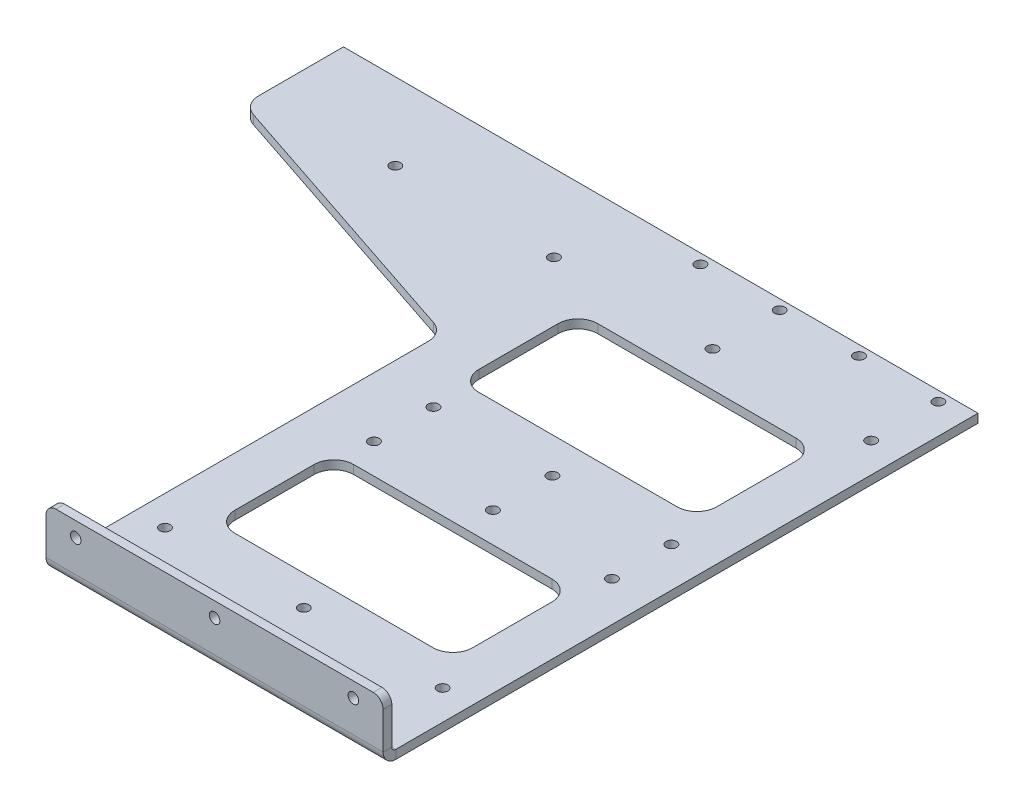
ISO-10303-21;
HEADER;
FILE_DESCRIPTION(('STEP AP214'),'2;1');
FILE_NAME('part.step','',(''),(''),'','','');
FILE_SCHEMA(('AUTOMOTIVE_DESIGN { 1 0 10303 214 1 1 1 1 }'));
ENDSEC;
DATA;
#1=APPLICATION_CONTEXT('core data for automotive mechanical design processes');
#2=APPLICATION_PROTOCOL_DEFINITION('international standard','automotive_design',2000,#1);
#3=PRODUCT_CONTEXT('',#1,'mechanical');
#4=PRODUCT('Part','Part','',(#3));
#5=PRODUCT_RELATED_PRODUCT_CATEGORY('part','',(#4));
#6=PRODUCT_DEFINITION_FORMATION('','',#4);
#7=PRODUCT_DEFINITION_CONTEXT('part definition',#1,'design');
#8=PRODUCT_DEFINITION('design','',#6,#7);
#9=PRODUCT_DEFINITION_SHAPE('','',#8);
#10=(LENGTH_UNIT() NAMED_UNIT(*) SI_UNIT(.MILLI.,.METRE.));
#11=(NAMED_UNIT(*) PLANE_ANGLE_UNIT() SI_UNIT($,.RADIAN.));
#12=(NAMED_UNIT(*) SI_UNIT($,.STERADIAN.) SOLID_ANGLE_UNIT());
#13=UNCERTAINTY_MEASURE_WITH_UNIT(LENGTH_MEASURE(1.E-05),#10,'distance_accuracy_value','');
#14=(GEOMETRIC_REPRESENTATION_CONTEXT(3) GLOBAL_UNCERTAINTY_ASSIGNED_CONTEXT((#13)) GLOBAL_UNIT_ASSIGNED_CONTEXT((#10,
#11,#12)) REPRESENTATION_CONTEXT('',''));
#15=CARTESIAN_POINT('',(0.,0.,0.));
#16=DIRECTION('',(0.,0.,1.));
#17=DIRECTION('',(1.,0.,0.));
#18=AXIS2_PLACEMENT_3D('',#15,#16,#17);
#19=CARTESIAN_POINT('',(0.,-5.588,0.));
#20=DIRECTION('',(1.,0.,0.));
#21=DIRECTION('',(0.,0.,-1.));
#22=AXIS2_PLACEMENT_3D('',#19,#20,#21);
#23=PLANE('',#22);
#24=DIRECTION('',(0.,0.,-1.));
#25=VECTOR('',#24,1.);
#26=CARTESIAN_POINT('',(0.,0.,0.));
#27=LINE('',#26,#25);
#28=CARTESIAN_POINT('',(0.,0.,-8.128));
#29=VERTEX_POINT('',#28);
#30=CARTESIAN_POINT('',(0.,0.,-381.));
#31=VERTEX_POINT('',#30);
#32=EDGE_CURVE('E580',#29,#31,#27,.T.);
#33=ORIENTED_EDGE('',*,*,#32,.F.);
#34=DIRECTION('',(0.,-1.,0.));
#35=VECTOR('',#34,1.);
#36=CARTESIAN_POINT('',(0.,0.,-8.128));
#37=LINE('',#36,#35);
#38=CARTESIAN_POINT('',(0.,-5.58800000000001,-8.128));
#39=VERTEX_POINT('',#38);
#40=EDGE_CURVE('E319',#29,#39,#37,.T.);
#41=ORIENTED_EDGE('',*,*,#40,.T.);
#42=DIRECTION('',(0.,0.,-1.));
#43=VECTOR('',#42,1.);
#44=CARTESIAN_POINT('',(0.,-5.588,0.));
#45=LINE('',#44,#43);
#46=CARTESIAN_POINT('',(0.,-5.588,-381.));
#47=VERTEX_POINT('',#46);
#48=EDGE_CURVE('E581',#39,#47,#45,.T.);
#49=ORIENTED_EDGE('',*,*,#48,.T.);
#50=DIRECTION('',(0.,1.,0.));
#51=VECTOR('',#50,1.);
#52=CARTESIAN_POINT('',(0.,-5.588,-381.));
#53=LINE('',#52,#51);
#54=EDGE_CURVE('E594',#47,#31,#53,.T.);
#55=ORIENTED_EDGE('',*,*,#54,.T.);
#56=EDGE_LOOP('',(#33,#41,#49,#55));
#57=FACE_BOUND('',#56,.T.);
#58=ADVANCED_FACE('F62',(#57),#23,.T.);
#59=CARTESIAN_POINT('',(0.,-5.588,0.));
#60=DIRECTION('',(0.,1.,0.));
#61=DIRECTION('',(0.,0.,1.));
#62=AXIS2_PLACEMENT_3D('',#59,#60,#61);
#63=PLANE('',#62);
#64=CARTESIAN_POINT('',(-19.05,-5.588,-57.15));
#65=DIRECTION('',(0.,1.,0.));
#66=DIRECTION('',(0.,0.,1.));
#67=AXIS2_PLACEMENT_3D('',#64,#65,#66);
#68=CIRCLE('',#67,3.37819999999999);
#69=CARTESIAN_POINT('',(-19.05,-5.588,-53.7718));
#70=VERTEX_POINT('',#69);
#71=EDGE_CURVE('E577',#70,#70,#68,.T.);
#72=ORIENTED_EDGE('',*,*,#71,.T.);
#73=EDGE_LOOP('',(#72));
#74=FACE_BOUND('',#73,.T.);
#75=CARTESIAN_POINT('',(-107.95,-5.588,-57.15));
#76=DIRECTION('',(0.,1.,0.));
#77=DIRECTION('',(0.,0.,1.));
#78=AXIS2_PLACEMENT_3D('',#75,#76,#77);
#79=CIRCLE('',#78,3.37819999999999);
#80=CARTESIAN_POINT('',(-107.95,-5.588,-53.7718));
#81=VERTEX_POINT('',#80);
#82=EDGE_CURVE('E571',#81,#81,#79,.T.);
#83=ORIENTED_EDGE('',*,*,#82,.T.);
#84=EDGE_LOOP('',(#83));
#85=FACE_BOUND('',#84,.T.);
#86=CARTESIAN_POINT('',(-196.85,-5.588,-57.15));
#87=DIRECTION('',(0.,1.,0.));
#88=DIRECTION('',(0.,0.,1.));
#89=AXIS2_PLACEMENT_3D('',#86,#87,#88);
#90=CIRCLE('',#89,3.3782);
#91=CARTESIAN_POINT('',(-196.85,-5.588,-53.7718));
#92=VERTEX_POINT('',#91);
#93=EDGE_CURVE('E565',#92,#92,#90,.T.);
#94=ORIENTED_EDGE('',*,*,#93,.T.);
#95=EDGE_LOOP('',(#94));
#96=FACE_BOUND('',#95,.T.);
#97=CARTESIAN_POINT('',(-19.05,-5.588,-19.05));
#98=DIRECTION('',(0.,1.,0.));
#99=DIRECTION('',(0.,0.,1.));
#100=AXIS2_PLACEMENT_3D('',#97,#98,#99);
#101=CIRCLE('',#100,3.37819999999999);
#102=CARTESIAN_POINT('',(-19.05,-5.588,-15.6718));
#103=VERTEX_POINT('',#102);
#104=EDGE_CURVE('E559',#103,#103,#101,.T.);
#105=ORIENTED_EDGE('',*,*,#104,.T.);
#106=EDGE_LOOP('',(#105));
#107=FACE_BOUND('',#106,.T.);
#108=CARTESIAN_POINT('',(-107.95,-5.588,-19.05));
#109=DIRECTION('',(0.,1.,0.));
#110=DIRECTION('',(0.,0.,1.));
#111=AXIS2_PLACEMENT_3D('',#108,#109,#110);
#112=CIRCLE('',#111,3.37819999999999);
#113=CARTESIAN_POINT('',(-107.95,-5.588,-15.6718));
#114=VERTEX_POINT('',#113);
#115=EDGE_CURVE('E553',#114,#114,#112,.T.);
#116=ORIENTED_EDGE('',*,*,#115,.T.);
#117=EDGE_LOOP('',(#116));
#118=FACE_BOUND('',#117,.T.);
#119=CARTESIAN_POINT('',(-196.85,-5.588,-19.05));
#120=DIRECTION('',(0.,1.,0.));
#121=DIRECTION('',(0.,0.,1.));
#122=AXIS2_PLACEMENT_3D('',#119,#120,#121);
#123=CIRCLE('',#122,3.3782);
#124=CARTESIAN_POINT('',(-196.85,-5.588,-15.6718));
#125=VERTEX_POINT('',#124);
#126=EDGE_CURVE('E547',#125,#125,#123,.T.);
#127=ORIENTED_EDGE('',*,*,#126,.T.);
#128=EDGE_LOOP('',(#127));
#129=FACE_BOUND('',#128,.T.);
#130=CARTESIAN_POINT('',(-177.8,-5.588,-171.9326));
#131=DIRECTION('',(0.,1.,0.));
#132=DIRECTION('',(0.,0.,1.));
#133=AXIS2_PLACEMENT_3D('',#130,#131,#132);
#134=CIRCLE('',#133,3.3782);
#135=CARTESIAN_POINT('',(-177.8,-5.588,-168.5544));
#136=VERTEX_POINT('',#135);
#137=EDGE_CURVE('E541',#136,#136,#134,.T.);
#138=ORIENTED_EDGE('',*,*,#137,.T.);
#139=EDGE_LOOP('',(#138));
#140=FACE_BOUND('',#139,.T.);
#141=CARTESIAN_POINT('',(-101.6,-5.588,-171.9326));
#142=DIRECTION('',(0.,1.,0.));
#143=DIRECTION('',(0.,0.,1.));
#144=AXIS2_PLACEMENT_3D('',#141,#142,#143);
#145=CIRCLE('',#144,3.37819999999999);
#146=CARTESIAN_POINT('',(-101.6,-5.588,-168.5544));
#147=VERTEX_POINT('',#146);
#148=EDGE_CURVE('E535',#147,#147,#145,.T.);
#149=ORIENTED_EDGE('',*,*,#148,.T.);
#150=EDGE_LOOP('',(#149));
#151=FACE_BOUND('',#150,.T.);
#152=CARTESIAN_POINT('',(-25.4,-5.588,-171.9326));
#153=DIRECTION('',(0.,1.,0.));
#154=DIRECTION('',(0.,0.,1.));
#155=AXIS2_PLACEMENT_3D('',#152,#153,#154);
#156=CIRCLE('',#155,3.37819999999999);
#157=CARTESIAN_POINT('',(-25.4,-5.588,-168.5544));
#158=VERTEX_POINT('',#157);
#159=EDGE_CURVE('E529',#158,#158,#156,.T.);
#160=ORIENTED_EDGE('',*,*,#159,.T.);
#161=EDGE_LOOP('',(#160));
#162=FACE_BOUND('',#161,.T.);
#163=CARTESIAN_POINT('',(-25.4,-5.588,-210.0326));
#164=DIRECTION('',(0.,1.,0.));
#165=DIRECTION('',(0.,0.,1.));
#166=AXIS2_PLACEMENT_3D('',#163,#164,#165);
#167=CIRCLE('',#166,3.37819999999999);
#168=CARTESIAN_POINT('',(-25.4,-5.588,-206.6544));
#169=VERTEX_POINT('',#168);
#170=EDGE_CURVE('E523',#169,#169,#167,.T.);
#171=ORIENTED_EDGE('',*,*,#170,.T.);
#172=EDGE_LOOP('',(#171));
#173=FACE_BOUND('',#172,.T.);
#174=CARTESIAN_POINT('',(-101.6,-5.588,-210.0326));
#175=DIRECTION('',(0.,1.,0.));
#176=DIRECTION('',(0.,0.,1.));
#177=AXIS2_PLACEMENT_3D('',#174,#175,#176);
#178=CIRCLE('',#177,3.37819999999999);
#179=CARTESIAN_POINT('',(-101.6,-5.588,-206.6544));
#180=VERTEX_POINT('',#179);
#181=EDGE_CURVE('E517',#180,#180,#178,.T.);
#182=ORIENTED_EDGE('',*,*,#181,.T.);
#183=EDGE_LOOP('',(#182));
#184=FACE_BOUND('',#183,.T.);
#185=CARTESIAN_POINT('',(-177.8,-5.588,-210.0326));
#186=DIRECTION('',(0.,1.,0.));
#187=DIRECTION('',(0.,0.,1.));
#188=AXIS2_PLACEMENT_3D('',#185,#186,#187);
#189=CIRCLE('',#188,3.3782);
#190=CARTESIAN_POINT('',(-177.8,-5.588,-206.6544));
#191=VERTEX_POINT('',#190);
#192=EDGE_CURVE('E511',#191,#191,#189,.T.);
#193=ORIENTED_EDGE('',*,*,#192,.T.);
#194=EDGE_LOOP('',(#193));
#195=FACE_BOUND('',#194,.T.);
#196=CARTESIAN_POINT('',(-171.45,-5.588,-374.65));
#197=DIRECTION('',(0.,1.,0.));
#198=DIRECTION('',(0.,0.,1.));
#199=AXIS2_PLACEMENT_3D('',#196,#197,#198);
#200=CIRCLE('',#199,3.3782);
#201=CARTESIAN_POINT('',(-171.45,-5.588,-371.2718));
#202=VERTEX_POINT('',#201);
#203=EDGE_CURVE('E505',#202,#202,#200,.T.);
#204=ORIENTED_EDGE('',*,*,#203,.T.);
#205=EDGE_LOOP('',(#204));
#206=FACE_BOUND('',#205,.T.);
#207=CARTESIAN_POINT('',(-120.65,-5.588,-374.65));
#208=DIRECTION('',(0.,1.,0.));
#209=DIRECTION('',(0.,0.,1.));
#210=AXIS2_PLACEMENT_3D('',#207,#208,#209);
#211=CIRCLE('',#210,3.37819999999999);
#212=CARTESIAN_POINT('',(-120.65,-5.588,-371.2718));
#213=VERTEX_POINT('',#212);
#214=EDGE_CURVE('E499',#213,#213,#211,.T.);
#215=ORIENTED_EDGE('',*,*,#214,.T.);
#216=EDGE_LOOP('',(#215));
#217=FACE_BOUND('',#216,.T.);
#218=CARTESIAN_POINT('',(-69.85,-5.588,-374.65));
#219=DIRECTION('',(0.,1.,0.));
#220=DIRECTION('',(0.,0.,1.));
#221=AXIS2_PLACEMENT_3D('',#218,#219,#220);
#222=CIRCLE('',#221,3.37819999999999);
#223=CARTESIAN_POINT('',(-69.85,-5.588,-371.2718));
#224=VERTEX_POINT('',#223);
#225=EDGE_CURVE('E493',#224,#224,#222,.T.);
#226=ORIENTED_EDGE('',*,*,#225,.T.);
#227=EDGE_LOOP('',(#226));
#228=FACE_BOUND('',#227,.T.);
#229=CARTESIAN_POINT('',(-19.05,-5.588,-374.65));
#230=DIRECTION('',(0.,1.,0.));
#231=DIRECTION('',(0.,0.,1.));
#232=AXIS2_PLACEMENT_3D('',#229,#230,#231);
#233=CIRCLE('',#232,3.37819999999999);
#234=CARTESIAN_POINT('',(-19.05,-5.588,-371.2718));
#235=VERTEX_POINT('',#234);
#236=EDGE_CURVE('E487',#235,#235,#233,.T.);
#237=ORIENTED_EDGE('',*,*,#236,.T.);
#238=EDGE_LOOP('',(#237));
#239=FACE_BOUND('',#238,.T.);
#240=CARTESIAN_POINT('',(-19.05,-5.588,-331.64145));
#241=DIRECTION('',(0.,1.,0.));
#242=DIRECTION('',(0.,0.,1.));
#243=AXIS2_PLACEMENT_3D('',#240,#241,#242);
#244=CIRCLE('',#243,3.37819999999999);
#245=CARTESIAN_POINT('',(-19.05,-5.588,-328.26325));
#246=VERTEX_POINT('',#245);
#247=EDGE_CURVE('E481',#246,#246,#244,.T.);
#248=ORIENTED_EDGE('',*,*,#247,.T.);
#249=EDGE_LOOP('',(#248));
#250=FACE_BOUND('',#249,.T.);
#251=CARTESIAN_POINT('',(-120.65,-5.588,-331.64145));
#252=DIRECTION('',(0.,1.,0.));
#253=DIRECTION('',(0.,0.,1.));
#254=AXIS2_PLACEMENT_3D('',#251,#252,#253);
#255=CIRCLE('',#254,3.37819999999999);
#256=CARTESIAN_POINT('',(-120.65,-5.588,-328.26325));
#257=VERTEX_POINT('',#256);
#258=EDGE_CURVE('E475',#257,#257,#255,.T.);
#259=ORIENTED_EDGE('',*,*,#258,.T.);
#260=EDGE_LOOP('',(#259));
#261=FACE_BOUND('',#260,.T.);
#262=CARTESIAN_POINT('',(-222.25,-5.588,-331.64145));
#263=DIRECTION('',(0.,1.,0.));
#264=DIRECTION('',(0.,0.,1.));
#265=AXIS2_PLACEMENT_3D('',#262,#263,#264);
#266=CIRCLE('',#265,3.3782);
#267=CARTESIAN_POINT('',(-222.25,-5.588,-328.26325));
#268=VERTEX_POINT('',#267);
#269=EDGE_CURVE('E469',#268,#268,#266,.T.);
#270=ORIENTED_EDGE('',*,*,#269,.T.);
#271=EDGE_LOOP('',(#270));
#272=FACE_BOUND('',#271,.T.);
#273=CARTESIAN_POINT('',(-323.85,-5.588,-331.64145));
#274=DIRECTION('',(0.,1.,0.));
#275=DIRECTION('',(0.,0.,1.));
#276=AXIS2_PLACEMENT_3D('',#273,#274,#275);
#277=CIRCLE('',#276,3.3782);
#278=CARTESIAN_POINT('',(-323.85,-5.588,-328.26325));
#279=VERTEX_POINT('',#278);
#280=EDGE_CURVE('E463',#279,#279,#277,.T.);
#281=ORIENTED_EDGE('',*,*,#280,.T.);
#282=EDGE_LOOP('',(#281));
#283=FACE_BOUND('',#282,.T.);
#284=DIRECTION('',(0.,0.,1.));
#285=VECTOR('',#284,1.);
#286=CARTESIAN_POINT('',(-184.15,-5.588,-296.237025));
#287=LINE('',#286,#285);
#288=CARTESIAN_POINT('',(-184.15,-5.588,-296.237025));
#289=VERTEX_POINT('',#288);
#290=CARTESIAN_POINT('',(-184.15,-5.588,-245.437025));
#291=VERTEX_POINT('',#290);
#292=EDGE_CURVE('E402',#289,#291,#287,.T.);
#293=ORIENTED_EDGE('',*,*,#292,.T.);
#294=CARTESIAN_POINT('',(-171.45,-5.588,-245.437025));
#295=DIRECTION('',(0.,1.,0.));
#296=DIRECTION('',(0.,0.,1.));
#297=AXIS2_PLACEMENT_3D('',#294,#295,#296);
#298=CIRCLE('',#297,12.7);
#299=CARTESIAN_POINT('',(-171.45,-5.588,-232.737025));
#300=VERTEX_POINT('',#299);
#301=EDGE_CURVE('E420',#291,#300,#298,.T.);
#302=ORIENTED_EDGE('',*,*,#301,.T.);
#303=DIRECTION('',(1.,0.,0.));
#304=VECTOR('',#303,1.);
#305=CARTESIAN_POINT('',(-171.45,-5.588,-232.737025));
#306=LINE('',#305,#304);
#307=CARTESIAN_POINT('',(-44.45,-5.588,-232.737025));
#308=VERTEX_POINT('',#307);
#309=EDGE_CURVE('E456',#300,#308,#306,.T.);
#310=ORIENTED_EDGE('',*,*,#309,.T.);
#311=CARTESIAN_POINT('',(-44.45,-5.588,-245.437025));
#312=DIRECTION('',(0.,1.,0.));
#313=DIRECTION('',(0.,0.,1.));
#314=AXIS2_PLACEMENT_3D('',#311,#312,#313);
#315=CIRCLE('',#314,12.7);
#316=CARTESIAN_POINT('',(-31.75,-5.588,-245.437025));
#317=VERTEX_POINT('',#316);
#318=EDGE_CURVE('E453',#308,#317,#315,.T.);
#319=ORIENTED_EDGE('',*,*,#318,.T.);
#320=DIRECTION('',(0.,0.,-1.));
#321=VECTOR('',#320,1.);
#322=CARTESIAN_POINT('',(-31.75,-5.588,-296.237025));
#323=LINE('',#322,#321);
#324=CARTESIAN_POINT('',(-31.75,-5.588,-296.237025));
#325=VERTEX_POINT('',#324);
#326=EDGE_CURVE('E450',#317,#325,#323,.T.);
#327=ORIENTED_EDGE('',*,*,#326,.T.);
#328=CARTESIAN_POINT('',(-44.45,-5.588,-296.237025));
#329=DIRECTION('',(0.,1.,0.));
#330=DIRECTION('',(0.,0.,-1.));
#331=AXIS2_PLACEMENT_3D('',#328,#329,#330);
#332=CIRCLE('',#331,12.7);
#333=CARTESIAN_POINT('',(-44.45,-5.588,-308.937025));
#334=VERTEX_POINT('',#333);
#335=EDGE_CURVE('E447',#325,#334,#332,.T.);
#336=ORIENTED_EDGE('',*,*,#335,.T.);
#337=DIRECTION('',(-1.,0.,0.));
#338=VECTOR('',#337,1.);
#339=CARTESIAN_POINT('',(-171.45,-5.588,-308.937025));
#340=LINE('',#339,#338);
#341=CARTESIAN_POINT('',(-171.45,-5.588,-308.937025));
#342=VERTEX_POINT('',#341);
#343=EDGE_CURVE('E444',#334,#342,#340,.T.);
#344=ORIENTED_EDGE('',*,*,#343,.T.);
#345=CARTESIAN_POINT('',(-171.45,-5.588,-296.237025));
#346=DIRECTION('',(0.,1.,0.));
#347=DIRECTION('',(0.,0.,1.));
#348=AXIS2_PLACEMENT_3D('',#345,#346,#347);
#349=CIRCLE('',#348,12.7);
#350=EDGE_CURVE('E441',#342,#289,#349,.T.);
#351=ORIENTED_EDGE('',*,*,#350,.T.);
#352=EDGE_LOOP('',(#293,#302,#310,#319,#327,#336,#344,#351));
#353=FACE_BOUND('',#352,.T.);
#354=DIRECTION('',(0.,0.,1.));
#355=VECTOR('',#354,1.);
#356=CARTESIAN_POINT('',(-184.15,-5.588,-139.9413));
#357=LINE('',#356,#355);
#358=CARTESIAN_POINT('',(-184.15,-5.588,-139.9413));
#359=VERTEX_POINT('',#358);
#360=CARTESIAN_POINT('',(-184.15,-5.588,-89.1412999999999));
#361=VERTEX_POINT('',#360);
#362=EDGE_CURVE('E355',#359,#361,#357,.T.);
#363=ORIENTED_EDGE('',*,*,#362,.T.);
#364=CARTESIAN_POINT('',(-171.45,-5.588,-89.1412999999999));
#365=DIRECTION('',(0.,1.,0.));
#366=DIRECTION('',(0.,0.,1.));
#367=AXIS2_PLACEMENT_3D('',#364,#365,#366);
#368=CIRCLE('',#367,12.7);
#369=CARTESIAN_POINT('',(-171.45,-5.588,-76.4412999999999));
#370=VERTEX_POINT('',#369);
#371=EDGE_CURVE('E333',#361,#370,#368,.T.);
#372=ORIENTED_EDGE('',*,*,#371,.T.);
#373=DIRECTION('',(1.,0.,0.));
#374=VECTOR('',#373,1.);
#375=CARTESIAN_POINT('',(-171.45,-5.588,-76.4412999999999));
#376=LINE('',#375,#374);
#377=CARTESIAN_POINT('',(-44.45,-5.588,-76.4412999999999));
#378=VERTEX_POINT('',#377);
#379=EDGE_CURVE('E336',#370,#378,#376,.T.);
#380=ORIENTED_EDGE('',*,*,#379,.T.);
#381=CARTESIAN_POINT('',(-44.45,-5.588,-89.1413));
#382=DIRECTION('',(0.,1.,0.));
#383=DIRECTION('',(0.,0.,1.));
#384=AXIS2_PLACEMENT_3D('',#381,#382,#383);
#385=CIRCLE('',#384,12.7);
#386=CARTESIAN_POINT('',(-31.75,-5.588,-89.1412999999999));
#387=VERTEX_POINT('',#386);
#388=EDGE_CURVE('E340',#378,#387,#385,.T.);
#389=ORIENTED_EDGE('',*,*,#388,.T.);
#390=DIRECTION('',(0.,0.,-1.));
#391=VECTOR('',#390,1.);
#392=CARTESIAN_POINT('',(-31.75,-5.588,-139.9413));
#393=LINE('',#392,#391);
#394=CARTESIAN_POINT('',(-31.75,-5.588,-139.9413));
#395=VERTEX_POINT('',#394);
#396=EDGE_CURVE('E343',#387,#395,#393,.T.);
#397=ORIENTED_EDGE('',*,*,#396,.T.);
#398=CARTESIAN_POINT('',(-44.45,-5.588,-139.9413));
#399=DIRECTION('',(0.,1.,0.));
#400=DIRECTION('',(0.,0.,-1.));
#401=AXIS2_PLACEMENT_3D('',#398,#399,#400);
#402=CIRCLE('',#401,12.7);
#403=CARTESIAN_POINT('',(-44.45,-5.588,-152.6413));
#404=VERTEX_POINT('',#403);
#405=EDGE_CURVE('E346',#395,#404,#402,.T.);
#406=ORIENTED_EDGE('',*,*,#405,.T.);
#407=DIRECTION('',(-1.,0.,0.));
#408=VECTOR('',#407,1.);
#409=CARTESIAN_POINT('',(-171.45,-5.588,-152.6413));
#410=LINE('',#409,#408);
#411=CARTESIAN_POINT('',(-171.45,-5.588,-152.6413));
#412=VERTEX_POINT('',#411);
#413=EDGE_CURVE('E349',#404,#412,#410,.T.);
#414=ORIENTED_EDGE('',*,*,#413,.T.);
#415=CARTESIAN_POINT('',(-171.45,-5.588,-139.9413));
#416=DIRECTION('',(0.,1.,0.));
#417=DIRECTION('',(0.,0.,1.));
#418=AXIS2_PLACEMENT_3D('',#415,#416,#417);
#419=CIRCLE('',#418,12.7);
#420=EDGE_CURVE('E352',#412,#359,#419,.T.);
#421=ORIENTED_EDGE('',*,*,#420,.T.);
#422=EDGE_LOOP('',(#363,#372,#380,#389,#397,#406,#414,#421));
#423=FACE_BOUND('',#422,.T.);
#424=DIRECTION('',(0.948683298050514,0.,0.316227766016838));
#425=VECTOR('',#424,1.);
#426=CARTESIAN_POINT('',(-406.4,-5.588,-317.5));
#427=LINE('',#426,#425);
#428=CARTESIAN_POINT('',(-397.716092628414,-5.588,-314.605364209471));
#429=VERTEX_POINT('',#428);
#430=CARTESIAN_POINT('',(-224.583907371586,-5.588,-256.894635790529));
#431=VERTEX_POINT('',#430);
#432=EDGE_CURVE('E589',#429,#431,#427,.T.);
#433=ORIENTED_EDGE('',*,*,#432,.F.);
#434=CARTESIAN_POINT('',(-393.7,-5.588,-326.653642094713));
#435=DIRECTION('',(0.,1.,0.));
#436=DIRECTION('',(0.,0.,1.));
#437=AXIS2_PLACEMENT_3D('',#434,#435,#436);
#438=CIRCLE('',#437,12.7);
#439=CARTESIAN_POINT('',(-406.4,-5.588,-326.653642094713));
#440=VERTEX_POINT('',#439);
#441=EDGE_CURVE('E77',#429,#440,#438,.F.);
#442=ORIENTED_EDGE('',*,*,#441,.T.);
#443=DIRECTION('',(0.,0.,1.));
#444=VECTOR('',#443,1.);
#445=CARTESIAN_POINT('',(-406.4,-5.588,-381.));
#446=LINE('',#445,#444);
#447=CARTESIAN_POINT('',(-406.4,-5.588,-381.));
#448=VERTEX_POINT('',#447);
#449=EDGE_CURVE('E587',#448,#440,#446,.T.);
#450=ORIENTED_EDGE('',*,*,#449,.F.);
#451=DIRECTION('',(-1.,0.,0.));
#452=VECTOR('',#451,1.);
#453=CARTESIAN_POINT('',(0.,-5.588,-381.));
#454=LINE('',#453,#452);
#455=EDGE_CURVE('E583',#47,#448,#454,.T.);
#456=ORIENTED_EDGE('',*,*,#455,.F.);
#457=ORIENTED_EDGE('',*,*,#48,.F.);
#458=DIRECTION('',(1.,0.,0.));
#459=VECTOR('',#458,1.);
#460=CARTESIAN_POINT('',(0.,-5.58800000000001,-8.128));
#461=LINE('',#460,#459);
#462=CARTESIAN_POINT('',(-215.9,-5.588,-8.128));
#463=VERTEX_POINT('',#462);
#464=EDGE_CURVE('E270',#39,#463,#461,.F.);
#465=ORIENTED_EDGE('',*,*,#464,.T.);
#466=DIRECTION('',(0.,0.,1.));
#467=VECTOR('',#466,1.);
#468=CARTESIAN_POINT('',(-215.9,-5.588,-254.));
#469=LINE('',#468,#467);
#470=CARTESIAN_POINT('',(-215.9,-5.588,-244.846357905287));
#471=VERTEX_POINT('',#470);
#472=EDGE_CURVE('E592',#471,#463,#469,.T.);
#473=ORIENTED_EDGE('',*,*,#472,.F.);
#474=CARTESIAN_POINT('',(-228.6,-5.588,-244.846357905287));
#475=DIRECTION('',(0.,1.,0.));
#476=DIRECTION('',(0.,0.,1.));
#477=AXIS2_PLACEMENT_3D('',#474,#475,#476);
#478=CIRCLE('',#477,12.7);
#479=EDGE_CURVE('E13',#471,#431,#478,.T.);
#480=ORIENTED_EDGE('',*,*,#479,.T.);
#481=EDGE_LOOP('',(#433,#442,#450,#456,#457,#465,#473,#480));
#482=FACE_BOUND('',#481,.T.);
#483=ADVANCED_FACE('F650',(#74,#85,#96,#107,#118,#129,#140,#151,#162,#173,#184,#195,#206,#217,
#228,#239,#250,#261,#272,#283,#353,#423,#482),#63,.F.);
#484=CARTESIAN_POINT('',(0.,0.,0.));
#485=DIRECTION('',(0.,1.,0.));
#486=DIRECTION('',(0.,0.,1.));
#487=AXIS2_PLACEMENT_3D('',#484,#485,#486);
#488=PLANE('',#487);
#489=CARTESIAN_POINT('',(-171.45,0.,-89.1412999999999));
#490=DIRECTION('',(0.,1.,0.));
#491=DIRECTION('',(0.,0.,1.));
#492=AXIS2_PLACEMENT_3D('',#489,#490,#491);
#493=CIRCLE('',#492,12.7);
#494=CARTESIAN_POINT('',(-184.15,0.,-89.1412999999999));
#495=VERTEX_POINT('',#494);
#496=CARTESIAN_POINT('',(-171.45,0.,-76.4412999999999));
#497=VERTEX_POINT('',#496);
#498=EDGE_CURVE('E359',#495,#497,#493,.T.);
#499=ORIENTED_EDGE('',*,*,#498,.F.);
#500=DIRECTION('',(0.,0.,1.));
#501=VECTOR('',#500,1.);
#502=CARTESIAN_POINT('',(-184.15,0.,-139.9413));
#503=LINE('',#502,#501);
#504=CARTESIAN_POINT('',(-184.15,0.,-139.9413));
#505=VERTEX_POINT('',#504);
#506=EDGE_CURVE('E337',#505,#495,#503,.T.);
#507=ORIENTED_EDGE('',*,*,#506,.F.);
#508=CARTESIAN_POINT('',(-171.45,0.,-139.9413));
#509=DIRECTION('',(0.,1.,0.));
#510=DIRECTION('',(0.,0.,1.));
#511=AXIS2_PLACEMENT_3D('',#508,#509,#510);
#512=CIRCLE('',#511,12.7);
#513=CARTESIAN_POINT('',(-171.45,0.,-152.6413));
#514=VERTEX_POINT('',#513);
#515=EDGE_CURVE('E377',#514,#505,#512,.T.);
#516=ORIENTED_EDGE('',*,*,#515,.F.);
#517=DIRECTION('',(-1.,0.,0.));
#518=VECTOR('',#517,1.);
#519=CARTESIAN_POINT('',(-171.45,0.,-152.6413));
#520=LINE('',#519,#518);
#521=CARTESIAN_POINT('',(-44.45,0.,-152.6413));
#522=VERTEX_POINT('',#521);
#523=EDGE_CURVE('E374',#522,#514,#520,.T.);
#524=ORIENTED_EDGE('',*,*,#523,.F.);
#525=CARTESIAN_POINT('',(-44.45,0.,-139.9413));
#526=DIRECTION('',(0.,1.,0.));
#527=DIRECTION('',(0.,0.,-1.));
#528=AXIS2_PLACEMENT_3D('',#525,#526,#527);
#529=CIRCLE('',#528,12.7);
#530=CARTESIAN_POINT('',(-31.75,0.,-139.9413));
#531=VERTEX_POINT('',#530);
#532=EDGE_CURVE('E371',#531,#522,#529,.T.);
#533=ORIENTED_EDGE('',*,*,#532,.F.);
#534=DIRECTION('',(0.,0.,-1.));
#535=VECTOR('',#534,1.);
#536=CARTESIAN_POINT('',(-31.75,0.,-139.9413));
#537=LINE('',#536,#535);
#538=CARTESIAN_POINT('',(-31.75,0.,-89.1412999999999));
#539=VERTEX_POINT('',#538);
#540=EDGE_CURVE('E368',#539,#531,#537,.T.);
#541=ORIENTED_EDGE('',*,*,#540,.F.);
#542=CARTESIAN_POINT('',(-44.45,0.,-89.1413));
#543=DIRECTION('',(0.,1.,0.));
#544=DIRECTION('',(0.,0.,1.));
#545=AXIS2_PLACEMENT_3D('',#542,#543,#544);
#546=CIRCLE('',#545,12.7);
#547=CARTESIAN_POINT('',(-44.45,0.,-76.4413));
#548=VERTEX_POINT('',#547);
#549=EDGE_CURVE('E365',#548,#539,#546,.T.);
#550=ORIENTED_EDGE('',*,*,#549,.F.);
#551=DIRECTION('',(1.,0.,0.));
#552=VECTOR('',#551,1.);
#553=CARTESIAN_POINT('',(-171.45,0.,-76.4412999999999));
#554=LINE('',#553,#552);
#555=EDGE_CURVE('E361',#497,#548,#554,.T.);
#556=ORIENTED_EDGE('',*,*,#555,.F.);
#557=EDGE_LOOP('',(#499,#507,#516,#524,#533,#541,#550,#556));
#558=FACE_BOUND('',#557,.T.);
#559=CARTESIAN_POINT('',(-171.45,0.,-245.437025));
#560=DIRECTION('',(0.,1.,0.));
#561=DIRECTION('',(0.,0.,1.));
#562=AXIS2_PLACEMENT_3D('',#559,#560,#561);
#563=CIRCLE('',#562,12.7);
#564=CARTESIAN_POINT('',(-184.15,0.,-245.437025));
#565=VERTEX_POINT('',#564);
#566=CARTESIAN_POINT('',(-171.45,0.,-232.737025));
#567=VERTEX_POINT('',#566);
#568=EDGE_CURVE('E362',#565,#567,#563,.T.);
#569=ORIENTED_EDGE('',*,*,#568,.F.);
#570=DIRECTION('',(0.,0.,1.));
#571=VECTOR('',#570,1.);
#572=CARTESIAN_POINT('',(-184.15,0.,-296.237025));
#573=LINE('',#572,#571);
#574=CARTESIAN_POINT('',(-184.15,0.,-296.237025));
#575=VERTEX_POINT('',#574);
#576=EDGE_CURVE('E416',#575,#565,#573,.T.);
#577=ORIENTED_EDGE('',*,*,#576,.F.);
#578=CARTESIAN_POINT('',(-171.45,0.,-296.237025));
#579=DIRECTION('',(0.,1.,0.));
#580=DIRECTION('',(0.,0.,1.));
#581=AXIS2_PLACEMENT_3D('',#578,#579,#580);
#582=CIRCLE('',#581,12.7);
#583=CARTESIAN_POINT('',(-171.45,0.,-308.937025));
#584=VERTEX_POINT('',#583);
#585=EDGE_CURVE('E419',#584,#575,#582,.T.);
#586=ORIENTED_EDGE('',*,*,#585,.F.);
#587=DIRECTION('',(-1.,0.,0.));
#588=VECTOR('',#587,1.);
#589=CARTESIAN_POINT('',(-171.45,0.,-308.937025));
#590=LINE('',#589,#588);
#591=CARTESIAN_POINT('',(-44.45,0.,-308.937025));
#592=VERTEX_POINT('',#591);
#593=EDGE_CURVE('E423',#592,#584,#590,.T.);
#594=ORIENTED_EDGE('',*,*,#593,.F.);
#595=CARTESIAN_POINT('',(-44.45,0.,-296.237025));
#596=DIRECTION('',(0.,1.,0.));
#597=DIRECTION('',(0.,0.,-1.));
#598=AXIS2_PLACEMENT_3D('',#595,#596,#597);
#599=CIRCLE('',#598,12.7);
#600=CARTESIAN_POINT('',(-31.75,0.,-296.237025));
#601=VERTEX_POINT('',#600);
#602=EDGE_CURVE('E426',#601,#592,#599,.T.);
#603=ORIENTED_EDGE('',*,*,#602,.F.);
#604=DIRECTION('',(0.,0.,-1.));
#605=VECTOR('',#604,1.);
#606=CARTESIAN_POINT('',(-31.75,0.,-296.237025));
#607=LINE('',#606,#605);
#608=CARTESIAN_POINT('',(-31.75,0.,-245.437025));
#609=VERTEX_POINT('',#608);
#610=EDGE_CURVE('E429',#609,#601,#607,.T.);
#611=ORIENTED_EDGE('',*,*,#610,.F.);
#612=CARTESIAN_POINT('',(-44.45,0.,-245.437025));
#613=DIRECTION('',(0.,1.,0.));
#614=DIRECTION('',(0.,0.,1.));
#615=AXIS2_PLACEMENT_3D('',#612,#613,#614);
#616=CIRCLE('',#615,12.7);
#617=CARTESIAN_POINT('',(-44.45,0.,-232.737025));
#618=VERTEX_POINT('',#617);
#619=EDGE_CURVE('E432',#618,#609,#616,.T.);
#620=ORIENTED_EDGE('',*,*,#619,.F.);
#621=DIRECTION('',(1.,0.,0.));
#622=VECTOR('',#621,1.);
#623=CARTESIAN_POINT('',(-171.45,0.,-232.737025));
#624=LINE('',#623,#622);
#625=EDGE_CURVE('E435',#567,#618,#624,.T.);
#626=ORIENTED_EDGE('',*,*,#625,.F.);
#627=EDGE_LOOP('',(#569,#577,#586,#594,#603,#611,#620,#626));
#628=FACE_BOUND('',#627,.T.);
#629=CARTESIAN_POINT('',(-323.85,0.,-331.64145));
#630=DIRECTION('',(0.,1.,0.));
#631=DIRECTION('',(0.,0.,1.));
#632=AXIS2_PLACEMENT_3D('',#629,#630,#631);
#633=CIRCLE('',#632,3.3782);
#634=CARTESIAN_POINT('',(-323.85,0.,-328.26325));
#635=VERTEX_POINT('',#634);
#636=EDGE_CURVE('E384',#635,#635,#633,.T.);
#637=ORIENTED_EDGE('',*,*,#636,.F.);
#638=EDGE_LOOP('',(#637));
#639=FACE_BOUND('',#638,.T.);
#640=CARTESIAN_POINT('',(-222.25,0.,-331.64145));
#641=DIRECTION('',(0.,1.,0.));
#642=DIRECTION('',(0.,0.,1.));
#643=AXIS2_PLACEMENT_3D('',#640,#641,#642);
#644=CIRCLE('',#643,3.3782);
#645=CARTESIAN_POINT('',(-222.25,0.,-328.26325));
#646=VERTEX_POINT('',#645);
#647=EDGE_CURVE('E466',#646,#646,#644,.T.);
#648=ORIENTED_EDGE('',*,*,#647,.F.);
#649=EDGE_LOOP('',(#648));
#650=FACE_BOUND('',#649,.T.);
#651=CARTESIAN_POINT('',(-120.65,0.,-331.64145));
#652=DIRECTION('',(0.,1.,0.));
#653=DIRECTION('',(0.,0.,1.));
#654=AXIS2_PLACEMENT_3D('',#651,#652,#653);
#655=CIRCLE('',#654,3.37819999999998);
#656=CARTESIAN_POINT('',(-120.65,0.,-328.26325));
#657=VERTEX_POINT('',#656);
#658=EDGE_CURVE('E472',#657,#657,#655,.T.);
#659=ORIENTED_EDGE('',*,*,#658,.F.);
#660=EDGE_LOOP('',(#659));
#661=FACE_BOUND('',#660,.T.);
#662=CARTESIAN_POINT('',(-19.05,0.,-331.64145));
#663=DIRECTION('',(0.,1.,0.));
#664=DIRECTION('',(0.,0.,1.));
#665=AXIS2_PLACEMENT_3D('',#662,#663,#664);
#666=CIRCLE('',#665,3.37819999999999);
#667=CARTESIAN_POINT('',(-19.05,0.,-328.26325));
#668=VERTEX_POINT('',#667);
#669=EDGE_CURVE('E478',#668,#668,#666,.T.);
#670=ORIENTED_EDGE('',*,*,#669,.F.);
#671=EDGE_LOOP('',(#670));
#672=FACE_BOUND('',#671,.T.);
#673=CARTESIAN_POINT('',(-19.05,0.,-374.65));
#674=DIRECTION('',(0.,1.,0.));
#675=DIRECTION('',(0.,0.,1.));
#676=AXIS2_PLACEMENT_3D('',#673,#674,#675);
#677=CIRCLE('',#676,3.37819999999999);
#678=CARTESIAN_POINT('',(-19.05,0.,-371.2718));
#679=VERTEX_POINT('',#678);
#680=EDGE_CURVE('E484',#679,#679,#677,.T.);
#681=ORIENTED_EDGE('',*,*,#680,.F.);
#682=EDGE_LOOP('',(#681));
#683=FACE_BOUND('',#682,.T.);
#684=CARTESIAN_POINT('',(-69.85,0.,-374.65));
#685=DIRECTION('',(0.,1.,0.));
#686=DIRECTION('',(0.,0.,1.));
#687=AXIS2_PLACEMENT_3D('',#684,#685,#686);
#688=CIRCLE('',#687,3.37819999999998);
#689=CARTESIAN_POINT('',(-69.85,0.,-371.2718));
#690=VERTEX_POINT('',#689);
#691=EDGE_CURVE('E490',#690,#690,#688,.T.);
#692=ORIENTED_EDGE('',*,*,#691,.F.);
#693=EDGE_LOOP('',(#692));
#694=FACE_BOUND('',#693,.T.);
#695=CARTESIAN_POINT('',(-120.65,0.,-374.65));
#696=DIRECTION('',(0.,1.,0.));
#697=DIRECTION('',(0.,0.,1.));
#698=AXIS2_PLACEMENT_3D('',#695,#696,#697);
#699=CIRCLE('',#698,3.37819999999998);
#700=CARTESIAN_POINT('',(-120.65,0.,-371.2718));
#701=VERTEX_POINT('',#700);
#702=EDGE_CURVE('E496',#701,#701,#699,.T.);
#703=ORIENTED_EDGE('',*,*,#702,.F.);
#704=EDGE_LOOP('',(#703));
#705=FACE_BOUND('',#704,.T.);
#706=CARTESIAN_POINT('',(-171.45,0.,-374.65));
#707=DIRECTION('',(0.,1.,0.));
#708=DIRECTION('',(0.,0.,1.));
#709=AXIS2_PLACEMENT_3D('',#706,#707,#708);
#710=CIRCLE('',#709,3.3782);
#711=CARTESIAN_POINT('',(-171.45,0.,-371.2718));
#712=VERTEX_POINT('',#711);
#713=EDGE_CURVE('E502',#712,#712,#710,.T.);
#714=ORIENTED_EDGE('',*,*,#713,.F.);
#715=EDGE_LOOP('',(#714));
#716=FACE_BOUND('',#715,.T.);
#717=CARTESIAN_POINT('',(-177.8,0.,-210.0326));
#718=DIRECTION('',(0.,1.,0.));
#719=DIRECTION('',(0.,0.,1.));
#720=AXIS2_PLACEMENT_3D('',#717,#718,#719);
#721=CIRCLE('',#720,3.3782);
#722=CARTESIAN_POINT('',(-177.8,0.,-206.6544));
#723=VERTEX_POINT('',#722);
#724=EDGE_CURVE('E508',#723,#723,#721,.T.);
#725=ORIENTED_EDGE('',*,*,#724,.F.);
#726=EDGE_LOOP('',(#725));
#727=FACE_BOUND('',#726,.T.);
#728=CARTESIAN_POINT('',(-101.6,0.,-210.0326));
#729=DIRECTION('',(0.,1.,0.));
#730=DIRECTION('',(0.,0.,1.));
#731=AXIS2_PLACEMENT_3D('',#728,#729,#730);
#732=CIRCLE('',#731,3.37819999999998);
#733=CARTESIAN_POINT('',(-101.6,0.,-206.6544));
#734=VERTEX_POINT('',#733);
#735=EDGE_CURVE('E514',#734,#734,#732,.T.);
#736=ORIENTED_EDGE('',*,*,#735,.F.);
#737=EDGE_LOOP('',(#736));
#738=FACE_BOUND('',#737,.T.);
#739=CARTESIAN_POINT('',(-25.4,0.,-210.0326));
#740=DIRECTION('',(0.,1.,0.));
#741=DIRECTION('',(0.,0.,1.));
#742=AXIS2_PLACEMENT_3D('',#739,#740,#741);
#743=CIRCLE('',#742,3.37819999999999);
#744=CARTESIAN_POINT('',(-25.4,0.,-206.6544));
#745=VERTEX_POINT('',#744);
#746=EDGE_CURVE('E520',#745,#745,#743,.T.);
#747=ORIENTED_EDGE('',*,*,#746,.F.);
#748=EDGE_LOOP('',(#747));
#749=FACE_BOUND('',#748,.T.);
#750=CARTESIAN_POINT('',(-25.4,0.,-171.9326));
#751=DIRECTION('',(0.,1.,0.));
#752=DIRECTION('',(0.,0.,1.));
#753=AXIS2_PLACEMENT_3D('',#750,#751,#752);
#754=CIRCLE('',#753,3.37819999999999);
#755=CARTESIAN_POINT('',(-25.4,0.,-168.5544));
#756=VERTEX_POINT('',#755);
#757=EDGE_CURVE('E526',#756,#756,#754,.T.);
#758=ORIENTED_EDGE('',*,*,#757,.F.);
#759=EDGE_LOOP('',(#758));
#760=FACE_BOUND('',#759,.T.);
#761=CARTESIAN_POINT('',(-101.6,0.,-171.9326));
#762=DIRECTION('',(0.,1.,0.));
#763=DIRECTION('',(0.,0.,1.));
#764=AXIS2_PLACEMENT_3D('',#761,#762,#763);
#765=CIRCLE('',#764,3.37819999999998);
#766=CARTESIAN_POINT('',(-101.6,0.,-168.5544));
#767=VERTEX_POINT('',#766);
#768=EDGE_CURVE('E532',#767,#767,#765,.T.);
#769=ORIENTED_EDGE('',*,*,#768,.F.);
#770=EDGE_LOOP('',(#769));
#771=FACE_BOUND('',#770,.T.);
#772=CARTESIAN_POINT('',(-177.8,0.,-171.9326));
#773=DIRECTION('',(0.,1.,0.));
#774=DIRECTION('',(0.,0.,1.));
#775=AXIS2_PLACEMENT_3D('',#772,#773,#774);
#776=CIRCLE('',#775,3.3782);
#777=CARTESIAN_POINT('',(-177.8,0.,-168.5544));
#778=VERTEX_POINT('',#777);
#779=EDGE_CURVE('E538',#778,#778,#776,.T.);
#780=ORIENTED_EDGE('',*,*,#779,.F.);
#781=EDGE_LOOP('',(#780));
#782=FACE_BOUND('',#781,.T.);
#783=CARTESIAN_POINT('',(-196.85,0.,-19.05));
#784=DIRECTION('',(0.,1.,0.));
#785=DIRECTION('',(0.,0.,1.));
#786=AXIS2_PLACEMENT_3D('',#783,#784,#785);
#787=CIRCLE('',#786,3.3782);
#788=CARTESIAN_POINT('',(-196.85,0.,-15.6718));
#789=VERTEX_POINT('',#788);
#790=EDGE_CURVE('E544',#789,#789,#787,.T.);
#791=ORIENTED_EDGE('',*,*,#790,.F.);
#792=EDGE_LOOP('',(#791));
#793=FACE_BOUND('',#792,.T.);
#794=CARTESIAN_POINT('',(-107.95,0.,-19.05));
#795=DIRECTION('',(0.,1.,0.));
#796=DIRECTION('',(0.,0.,1.));
#797=AXIS2_PLACEMENT_3D('',#794,#795,#796);
#798=CIRCLE('',#797,3.37819999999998);
#799=CARTESIAN_POINT('',(-107.95,0.,-15.6718));
#800=VERTEX_POINT('',#799);
#801=EDGE_CURVE('E550',#800,#800,#798,.T.);
#802=ORIENTED_EDGE('',*,*,#801,.F.);
#803=EDGE_LOOP('',(#802));
#804=FACE_BOUND('',#803,.T.);
#805=CARTESIAN_POINT('',(-19.05,0.,-19.05));
#806=DIRECTION('',(0.,1.,0.));
#807=DIRECTION('',(0.,0.,1.));
#808=AXIS2_PLACEMENT_3D('',#805,#806,#807);
#809=CIRCLE('',#808,3.37819999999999);
#810=CARTESIAN_POINT('',(-19.05,0.,-15.6718));
#811=VERTEX_POINT('',#810);
#812=EDGE_CURVE('E556',#811,#811,#809,.T.);
#813=ORIENTED_EDGE('',*,*,#812,.F.);
#814=EDGE_LOOP('',(#813));
#815=FACE_BOUND('',#814,.T.);
#816=CARTESIAN_POINT('',(-196.85,0.,-57.15));
#817=DIRECTION('',(0.,1.,0.));
#818=DIRECTION('',(0.,0.,1.));
#819=AXIS2_PLACEMENT_3D('',#816,#817,#818);
#820=CIRCLE('',#819,3.3782);
#821=CARTESIAN_POINT('',(-196.85,0.,-53.7718));
#822=VERTEX_POINT('',#821);
#823=EDGE_CURVE('E562',#822,#822,#820,.T.);
#824=ORIENTED_EDGE('',*,*,#823,.F.);
#825=EDGE_LOOP('',(#824));
#826=FACE_BOUND('',#825,.T.);
#827=CARTESIAN_POINT('',(-107.95,0.,-57.15));
#828=DIRECTION('',(0.,1.,0.));
#829=DIRECTION('',(0.,0.,1.));
#830=AXIS2_PLACEMENT_3D('',#827,#828,#829);
#831=CIRCLE('',#830,3.37819999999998);
#832=CARTESIAN_POINT('',(-107.95,0.,-53.7718));
#833=VERTEX_POINT('',#832);
#834=EDGE_CURVE('E568',#833,#833,#831,.T.);
#835=ORIENTED_EDGE('',*,*,#834,.F.);
#836=EDGE_LOOP('',(#835));
#837=FACE_BOUND('',#836,.T.);
#838=CARTESIAN_POINT('',(-19.05,0.,-57.15));
#839=DIRECTION('',(0.,1.,0.));
#840=DIRECTION('',(0.,0.,1.));
#841=AXIS2_PLACEMENT_3D('',#838,#839,#840);
#842=CIRCLE('',#841,3.37819999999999);
#843=CARTESIAN_POINT('',(-19.05,0.,-53.7718));
#844=VERTEX_POINT('',#843);
#845=EDGE_CURVE('E574',#844,#844,#842,.T.);
#846=ORIENTED_EDGE('',*,*,#845,.F.);
#847=EDGE_LOOP('',(#846));
#848=FACE_BOUND('',#847,.T.);
#849=DIRECTION('',(0.,0.,1.));
#850=VECTOR('',#849,1.);
#851=CARTESIAN_POINT('',(-406.4,0.,-381.));
#852=LINE('',#851,#850);
#853=CARTESIAN_POINT('',(-406.4,0.,-381.));
#854=VERTEX_POINT('',#853);
#855=CARTESIAN_POINT('',(-406.4,0.,-326.653642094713));
#856=VERTEX_POINT('',#855);
#857=EDGE_CURVE('E599',#854,#856,#852,.T.);
#858=ORIENTED_EDGE('',*,*,#857,.T.);
#859=CARTESIAN_POINT('',(-393.7,0.,-326.653642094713));
#860=DIRECTION('',(0.,1.,0.));
#861=DIRECTION('',(0.,0.,1.));
#862=AXIS2_PLACEMENT_3D('',#859,#860,#861);
#863=CIRCLE('',#862,12.7);
#864=CARTESIAN_POINT('',(-397.716092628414,0.,-314.605364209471));
#865=VERTEX_POINT('',#864);
#866=EDGE_CURVE('E85',#856,#865,#863,.T.);
#867=ORIENTED_EDGE('',*,*,#866,.T.);
#868=DIRECTION('',(0.948683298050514,0.,0.316227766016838));
#869=VECTOR('',#868,1.);
#870=CARTESIAN_POINT('',(-406.4,0.,-317.5));
#871=LINE('',#870,#869);
#872=CARTESIAN_POINT('',(-224.583907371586,0.,-256.894635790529));
#873=VERTEX_POINT('',#872);
#874=EDGE_CURVE('E602',#865,#873,#871,.T.);
#875=ORIENTED_EDGE('',*,*,#874,.T.);
#876=CARTESIAN_POINT('',(-228.6,0.,-244.846357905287));
#877=DIRECTION('',(0.,1.,0.));
#878=DIRECTION('',(0.,0.,1.));
#879=AXIS2_PLACEMENT_3D('',#876,#877,#878);
#880=CIRCLE('',#879,12.7);
#881=CARTESIAN_POINT('',(-215.9,0.,-244.846357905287));
#882=VERTEX_POINT('',#881);
#883=EDGE_CURVE('E70',#873,#882,#880,.F.);
#884=ORIENTED_EDGE('',*,*,#883,.T.);
#885=DIRECTION('',(0.,0.,1.));
#886=VECTOR('',#885,1.);
#887=CARTESIAN_POINT('',(-215.9,0.,-254.));
#888=LINE('',#887,#886);
#889=CARTESIAN_POINT('',(-215.9,0.,-8.128));
#890=VERTEX_POINT('',#889);
#891=EDGE_CURVE('E584',#882,#890,#888,.T.);
#892=ORIENTED_EDGE('',*,*,#891,.T.);
#893=DIRECTION('',(1.,0.,0.));
#894=VECTOR('',#893,1.);
#895=CARTESIAN_POINT('',(0.,0.,-8.128));
#896=LINE('',#895,#894);
#897=EDGE_CURVE('E323',#29,#890,#896,.F.);
#898=ORIENTED_EDGE('',*,*,#897,.F.);
#899=ORIENTED_EDGE('',*,*,#32,.T.);
#900=DIRECTION('',(-1.,0.,0.));
#901=VECTOR('',#900,1.);
#902=CARTESIAN_POINT('',(0.,0.,-381.));
#903=LINE('',#902,#901);
#904=EDGE_CURVE('E596',#31,#854,#903,.T.);
#905=ORIENTED_EDGE('',*,*,#904,.T.);
#906=EDGE_LOOP('',(#858,#867,#875,#884,#892,#898,#899,#905));
#907=FACE_BOUND('',#906,.T.);
#908=ADVANCED_FACE('F639',(#558,#628,#639,#650,#661,#672,#683,#694,#705,#716,#727,#738,#749,
#760,#771,#782,#793,#804,#815,#826,#837,#848,#907),#488,.T.);
#909=CARTESIAN_POINT('',(-215.9,-5.588,-254.));
#910=DIRECTION('',(-1.,0.,0.));
#911=DIRECTION('',(0.,0.,1.));
#912=AXIS2_PLACEMENT_3D('',#909,#910,#911);
#913=PLANE('',#912);
#914=ORIENTED_EDGE('',*,*,#891,.F.);
#915=DIRECTION('',(0.,1.,0.));
#916=VECTOR('',#915,1.);
#917=CARTESIAN_POINT('',(-215.9,-5.588,-244.846357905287));
#918=LINE('',#917,#916);
#919=EDGE_CURVE('E632',#882,#471,#918,.F.);
#920=ORIENTED_EDGE('',*,*,#919,.T.);
#921=ORIENTED_EDGE('',*,*,#472,.T.);
#922=DIRECTION('',(0.,-1.,0.));
#923=VECTOR('',#922,1.);
#924=CARTESIAN_POINT('',(-215.9,0.,-8.128));
#925=LINE('',#924,#923);
#926=EDGE_CURVE('E327',#890,#463,#925,.T.);
#927=ORIENTED_EDGE('',*,*,#926,.F.);
#928=EDGE_LOOP('',(#914,#920,#921,#927));
#929=FACE_BOUND('',#928,.T.);
#930=ADVANCED_FACE('F646',(#929),#913,.T.);
#931=CARTESIAN_POINT('',(-406.4,-5.588,-317.5));
#932=DIRECTION('',(-0.316227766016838,0.,0.948683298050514));
#933=DIRECTION('',(0.948683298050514,0.,0.316227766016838));
#934=AXIS2_PLACEMENT_3D('',#931,#932,#933);
#935=PLANE('',#934);
#936=ORIENTED_EDGE('',*,*,#432,.T.);
#937=DIRECTION('',(0.,1.,0.));
#938=VECTOR('',#937,1.);
#939=CARTESIAN_POINT('',(-224.583907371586,0.,-256.894635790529));
#940=LINE('',#939,#938);
#941=EDGE_CURVE('E629',#431,#873,#940,.T.);
#942=ORIENTED_EDGE('',*,*,#941,.T.);
#943=ORIENTED_EDGE('',*,*,#874,.F.);
#944=DIRECTION('',(0.,1.,0.));
#945=VECTOR('',#944,1.);
#946=CARTESIAN_POINT('',(-397.716092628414,-5.588,-314.605364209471));
#947=LINE('',#946,#945);
#948=EDGE_CURVE('E627',#865,#429,#947,.F.);
#949=ORIENTED_EDGE('',*,*,#948,.T.);
#950=EDGE_LOOP('',(#936,#942,#943,#949));
#951=FACE_BOUND('',#950,.T.);
#952=ADVANCED_FACE('F652',(#951),#935,.T.);
#953=CARTESIAN_POINT('',(-406.4,-5.588,-381.));
#954=DIRECTION('',(-1.,0.,0.));
#955=DIRECTION('',(0.,0.,1.));
#956=AXIS2_PLACEMENT_3D('',#953,#954,#955);
#957=PLANE('',#956);
#958=ORIENTED_EDGE('',*,*,#449,.T.);
#959=DIRECTION('',(0.,1.,0.));
#960=VECTOR('',#959,1.);
#961=CARTESIAN_POINT('',(-406.4,-5.588,-326.653642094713));
#962=LINE('',#961,#960);
#963=EDGE_CURVE('E634',#440,#856,#962,.T.);
#964=ORIENTED_EDGE('',*,*,#963,.T.);
#965=ORIENTED_EDGE('',*,*,#857,.F.);
#966=DIRECTION('',(0.,1.,0.));
#967=VECTOR('',#966,1.);
#968=CARTESIAN_POINT('',(-406.4,-5.588,-381.));
#969=LINE('',#968,#967);
#970=EDGE_CURVE('E606',#448,#854,#969,.T.);
#971=ORIENTED_EDGE('',*,*,#970,.F.);
#972=EDGE_LOOP('',(#958,#964,#965,#971));
#973=FACE_BOUND('',#972,.T.);
#974=ADVANCED_FACE('F655',(#973),#957,.T.);
#975=CARTESIAN_POINT('',(0.,-5.588,-381.));
#976=DIRECTION('',(0.,0.,-1.));
#977=DIRECTION('',(-1.,0.,0.));
#978=AXIS2_PLACEMENT_3D('',#975,#976,#977);
#979=PLANE('',#978);
#980=ORIENTED_EDGE('',*,*,#904,.F.);
#981=ORIENTED_EDGE('',*,*,#54,.F.);
#982=ORIENTED_EDGE('',*,*,#455,.T.);
#983=ORIENTED_EDGE('',*,*,#970,.T.);
#984=EDGE_LOOP('',(#980,#981,#982,#983));
#985=FACE_BOUND('',#984,.T.);
#986=ADVANCED_FACE('F660',(#985),#979,.T.);
#987=CARTESIAN_POINT('',(-19.05,0.,-57.15));
#988=DIRECTION('',(0.,1.,0.));
#989=DIRECTION('',(0.,0.,1.));
#990=AXIS2_PLACEMENT_3D('',#987,#988,#989);
#991=CYLINDRICAL_SURFACE('',#990,3.37819999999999);
#992=ORIENTED_EDGE('',*,*,#71,.F.);
#993=EDGE_LOOP('',(#992));
#994=FACE_BOUND('',#993,.T.);
#995=ORIENTED_EDGE('',*,*,#845,.T.);
#996=EDGE_LOOP('',(#995));
#997=FACE_BOUND('',#996,.T.);
#998=ADVANCED_FACE('F1223',(#994,#997),#991,.F.);
#999=CARTESIAN_POINT('',(-107.95,0.,-57.15));
#1000=DIRECTION('',(0.,1.,0.));
#1001=DIRECTION('',(0.,0.,1.));
#1002=AXIS2_PLACEMENT_3D('',#999,#1000,#1001);
#1003=CYLINDRICAL_SURFACE('',#1002,3.37819999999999);
#1004=ORIENTED_EDGE('',*,*,#82,.F.);
#1005=EDGE_LOOP('',(#1004));
#1006=FACE_BOUND('',#1005,.T.);
#1007=ORIENTED_EDGE('',*,*,#834,.T.);
#1008=EDGE_LOOP('',(#1007));
#1009=FACE_BOUND('',#1008,.T.);
#1010=ADVANCED_FACE('F1213',(#1006,#1009),#1003,.F.);
#1011=CARTESIAN_POINT('',(-196.85,0.,-57.15));
#1012=DIRECTION('',(0.,1.,0.));
#1013=DIRECTION('',(0.,0.,1.));
#1014=AXIS2_PLACEMENT_3D('',#1011,#1012,#1013);
#1015=CYLINDRICAL_SURFACE('',#1014,3.3782);
#1016=ORIENTED_EDGE('',*,*,#93,.F.);
#1017=EDGE_LOOP('',(#1016));
#1018=FACE_BOUND('',#1017,.T.);
#1019=ORIENTED_EDGE('',*,*,#823,.T.);
#1020=EDGE_LOOP('',(#1019));
#1021=FACE_BOUND('',#1020,.T.);
#1022=ADVANCED_FACE('F1203',(#1018,#1021),#1015,.F.);
#1023=CARTESIAN_POINT('',(-19.05,0.,-19.05));
#1024=DIRECTION('',(0.,1.,0.));
#1025=DIRECTION('',(0.,0.,1.));
#1026=AXIS2_PLACEMENT_3D('',#1023,#1024,#1025);
#1027=CYLINDRICAL_SURFACE('',#1026,3.37819999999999);
#1028=ORIENTED_EDGE('',*,*,#104,.F.);
#1029=EDGE_LOOP('',(#1028));
#1030=FACE_BOUND('',#1029,.T.);
#1031=ORIENTED_EDGE('',*,*,#812,.T.);
#1032=EDGE_LOOP('',(#1031));
#1033=FACE_BOUND('',#1032,.T.);
#1034=ADVANCED_FACE('F1193',(#1030,#1033),#1027,.F.);
#1035=CARTESIAN_POINT('',(-107.95,0.,-19.05));
#1036=DIRECTION('',(0.,1.,0.));
#1037=DIRECTION('',(0.,0.,1.));
#1038=AXIS2_PLACEMENT_3D('',#1035,#1036,#1037);
#1039=CYLINDRICAL_SURFACE('',#1038,3.37819999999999);
#1040=ORIENTED_EDGE('',*,*,#115,.F.);
#1041=EDGE_LOOP('',(#1040));
#1042=FACE_BOUND('',#1041,.T.);
#1043=ORIENTED_EDGE('',*,*,#801,.T.);
#1044=EDGE_LOOP('',(#1043));
#1045=FACE_BOUND('',#1044,.T.);
#1046=ADVANCED_FACE('F1183',(#1042,#1045),#1039,.F.);
#1047=CARTESIAN_POINT('',(-196.85,0.,-19.05));
#1048=DIRECTION('',(0.,1.,0.));
#1049=DIRECTION('',(0.,0.,1.));
#1050=AXIS2_PLACEMENT_3D('',#1047,#1048,#1049);
#1051=CYLINDRICAL_SURFACE('',#1050,3.3782);
#1052=ORIENTED_EDGE('',*,*,#126,.F.);
#1053=EDGE_LOOP('',(#1052));
#1054=FACE_BOUND('',#1053,.T.);
#1055=ORIENTED_EDGE('',*,*,#790,.T.);
#1056=EDGE_LOOP('',(#1055));
#1057=FACE_BOUND('',#1056,.T.);
#1058=ADVANCED_FACE('F1173',(#1054,#1057),#1051,.F.);
#1059=CARTESIAN_POINT('',(-177.8,0.,-171.9326));
#1060=DIRECTION('',(0.,1.,0.));
#1061=DIRECTION('',(0.,0.,1.));
#1062=AXIS2_PLACEMENT_3D('',#1059,#1060,#1061);
#1063=CYLINDRICAL_SURFACE('',#1062,3.3782);
#1064=ORIENTED_EDGE('',*,*,#137,.F.);
#1065=EDGE_LOOP('',(#1064));
#1066=FACE_BOUND('',#1065,.T.);
#1067=ORIENTED_EDGE('',*,*,#779,.T.);
#1068=EDGE_LOOP('',(#1067));
#1069=FACE_BOUND('',#1068,.T.);
#1070=ADVANCED_FACE('F1163',(#1066,#1069),#1063,.F.);
#1071=CARTESIAN_POINT('',(-101.6,0.,-171.9326));
#1072=DIRECTION('',(0.,1.,0.));
#1073=DIRECTION('',(0.,0.,1.));
#1074=AXIS2_PLACEMENT_3D('',#1071,#1072,#1073);
#1075=CYLINDRICAL_SURFACE('',#1074,3.37819999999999);
#1076=ORIENTED_EDGE('',*,*,#148,.F.);
#1077=EDGE_LOOP('',(#1076));
#1078=FACE_BOUND('',#1077,.T.);
#1079=ORIENTED_EDGE('',*,*,#768,.T.);
#1080=EDGE_LOOP('',(#1079));
#1081=FACE_BOUND('',#1080,.T.);
#1082=ADVANCED_FACE('F1153',(#1078,#1081),#1075,.F.);
#1083=CARTESIAN_POINT('',(-25.4,0.,-171.9326));
#1084=DIRECTION('',(0.,1.,0.));
#1085=DIRECTION('',(0.,0.,1.));
#1086=AXIS2_PLACEMENT_3D('',#1083,#1084,#1085);
#1087=CYLINDRICAL_SURFACE('',#1086,3.37819999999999);
#1088=ORIENTED_EDGE('',*,*,#159,.F.);
#1089=EDGE_LOOP('',(#1088));
#1090=FACE_BOUND('',#1089,.T.);
#1091=ORIENTED_EDGE('',*,*,#757,.T.);
#1092=EDGE_LOOP('',(#1091));
#1093=FACE_BOUND('',#1092,.T.);
#1094=ADVANCED_FACE('F1143',(#1090,#1093),#1087,.F.);
#1095=CARTESIAN_POINT('',(-25.4,0.,-210.0326));
#1096=DIRECTION('',(0.,1.,0.));
#1097=DIRECTION('',(0.,0.,1.));
#1098=AXIS2_PLACEMENT_3D('',#1095,#1096,#1097);
#1099=CYLINDRICAL_SURFACE('',#1098,3.37819999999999);
#1100=ORIENTED_EDGE('',*,*,#170,.F.);
#1101=EDGE_LOOP('',(#1100));
#1102=FACE_BOUND('',#1101,.T.);
#1103=ORIENTED_EDGE('',*,*,#746,.T.);
#1104=EDGE_LOOP('',(#1103));
#1105=FACE_BOUND('',#1104,.T.);
#1106=ADVANCED_FACE('F1133',(#1102,#1105),#1099,.F.);
#1107=CARTESIAN_POINT('',(-101.6,0.,-210.0326));
#1108=DIRECTION('',(0.,1.,0.));
#1109=DIRECTION('',(0.,0.,1.));
#1110=AXIS2_PLACEMENT_3D('',#1107,#1108,#1109);
#1111=CYLINDRICAL_SURFACE('',#1110,3.37819999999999);
#1112=ORIENTED_EDGE('',*,*,#181,.F.);
#1113=EDGE_LOOP('',(#1112));
#1114=FACE_BOUND('',#1113,.T.);
#1115=ORIENTED_EDGE('',*,*,#735,.T.);
#1116=EDGE_LOOP('',(#1115));
#1117=FACE_BOUND('',#1116,.T.);
#1118=ADVANCED_FACE('F1123',(#1114,#1117),#1111,.F.);
#1119=CARTESIAN_POINT('',(-177.8,0.,-210.0326));
#1120=DIRECTION('',(0.,1.,0.));
#1121=DIRECTION('',(0.,0.,1.));
#1122=AXIS2_PLACEMENT_3D('',#1119,#1120,#1121);
#1123=CYLINDRICAL_SURFACE('',#1122,3.3782);
#1124=ORIENTED_EDGE('',*,*,#192,.F.);
#1125=EDGE_LOOP('',(#1124));
#1126=FACE_BOUND('',#1125,.T.);
#1127=ORIENTED_EDGE('',*,*,#724,.T.);
#1128=EDGE_LOOP('',(#1127));
#1129=FACE_BOUND('',#1128,.T.);
#1130=ADVANCED_FACE('F1113',(#1126,#1129),#1123,.F.);
#1131=CARTESIAN_POINT('',(-171.45,0.,-374.65));
#1132=DIRECTION('',(0.,1.,0.));
#1133=DIRECTION('',(0.,0.,1.));
#1134=AXIS2_PLACEMENT_3D('',#1131,#1132,#1133);
#1135=CYLINDRICAL_SURFACE('',#1134,3.3782);
#1136=ORIENTED_EDGE('',*,*,#203,.F.);
#1137=EDGE_LOOP('',(#1136));
#1138=FACE_BOUND('',#1137,.T.);
#1139=ORIENTED_EDGE('',*,*,#713,.T.);
#1140=EDGE_LOOP('',(#1139));
#1141=FACE_BOUND('',#1140,.T.);
#1142=ADVANCED_FACE('F1103',(#1138,#1141),#1135,.F.);
#1143=CARTESIAN_POINT('',(-120.65,0.,-374.65));
#1144=DIRECTION('',(0.,1.,0.));
#1145=DIRECTION('',(0.,0.,1.));
#1146=AXIS2_PLACEMENT_3D('',#1143,#1144,#1145);
#1147=CYLINDRICAL_SURFACE('',#1146,3.37819999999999);
#1148=ORIENTED_EDGE('',*,*,#214,.F.);
#1149=EDGE_LOOP('',(#1148));
#1150=FACE_BOUND('',#1149,.T.);
#1151=ORIENTED_EDGE('',*,*,#702,.T.);
#1152=EDGE_LOOP('',(#1151));
#1153=FACE_BOUND('',#1152,.T.);
#1154=ADVANCED_FACE('F1093',(#1150,#1153),#1147,.F.);
#1155=CARTESIAN_POINT('',(-69.85,0.,-374.65));
#1156=DIRECTION('',(0.,1.,0.));
#1157=DIRECTION('',(0.,0.,1.));
#1158=AXIS2_PLACEMENT_3D('',#1155,#1156,#1157);
#1159=CYLINDRICAL_SURFACE('',#1158,3.37819999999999);
#1160=ORIENTED_EDGE('',*,*,#225,.F.);
#1161=EDGE_LOOP('',(#1160));
#1162=FACE_BOUND('',#1161,.T.);
#1163=ORIENTED_EDGE('',*,*,#691,.T.);
#1164=EDGE_LOOP('',(#1163));
#1165=FACE_BOUND('',#1164,.T.);
#1166=ADVANCED_FACE('F1083',(#1162,#1165),#1159,.F.);
#1167=CARTESIAN_POINT('',(-19.05,0.,-374.65));
#1168=DIRECTION('',(0.,1.,0.));
#1169=DIRECTION('',(0.,0.,1.));
#1170=AXIS2_PLACEMENT_3D('',#1167,#1168,#1169);
#1171=CYLINDRICAL_SURFACE('',#1170,3.37819999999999);
#1172=ORIENTED_EDGE('',*,*,#236,.F.);
#1173=EDGE_LOOP('',(#1172));
#1174=FACE_BOUND('',#1173,.T.);
#1175=ORIENTED_EDGE('',*,*,#680,.T.);
#1176=EDGE_LOOP('',(#1175));
#1177=FACE_BOUND('',#1176,.T.);
#1178=ADVANCED_FACE('F1073',(#1174,#1177),#1171,.F.);
#1179=CARTESIAN_POINT('',(-19.05,0.,-331.64145));
#1180=DIRECTION('',(0.,1.,0.));
#1181=DIRECTION('',(0.,0.,1.));
#1182=AXIS2_PLACEMENT_3D('',#1179,#1180,#1181);
#1183=CYLINDRICAL_SURFACE('',#1182,3.37819999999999);
#1184=ORIENTED_EDGE('',*,*,#247,.F.);
#1185=EDGE_LOOP('',(#1184));
#1186=FACE_BOUND('',#1185,.T.);
#1187=ORIENTED_EDGE('',*,*,#669,.T.);
#1188=EDGE_LOOP('',(#1187));
#1189=FACE_BOUND('',#1188,.T.);
#1190=ADVANCED_FACE('F1063',(#1186,#1189),#1183,.F.);
#1191=CARTESIAN_POINT('',(-120.65,0.,-331.64145));
#1192=DIRECTION('',(0.,1.,0.));
#1193=DIRECTION('',(0.,0.,1.));
#1194=AXIS2_PLACEMENT_3D('',#1191,#1192,#1193);
#1195=CYLINDRICAL_SURFACE('',#1194,3.37819999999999);
#1196=ORIENTED_EDGE('',*,*,#258,.F.);
#1197=EDGE_LOOP('',(#1196));
#1198=FACE_BOUND('',#1197,.T.);
#1199=ORIENTED_EDGE('',*,*,#658,.T.);
#1200=EDGE_LOOP('',(#1199));
#1201=FACE_BOUND('',#1200,.T.);
#1202=ADVANCED_FACE('F1053',(#1198,#1201),#1195,.F.);
#1203=CARTESIAN_POINT('',(-222.25,0.,-331.64145));
#1204=DIRECTION('',(0.,1.,0.));
#1205=DIRECTION('',(0.,0.,1.));
#1206=AXIS2_PLACEMENT_3D('',#1203,#1204,#1205);
#1207=CYLINDRICAL_SURFACE('',#1206,3.3782);
#1208=ORIENTED_EDGE('',*,*,#269,.F.);
#1209=EDGE_LOOP('',(#1208));
#1210=FACE_BOUND('',#1209,.T.);
#1211=ORIENTED_EDGE('',*,*,#647,.T.);
#1212=EDGE_LOOP('',(#1211));
#1213=FACE_BOUND('',#1212,.T.);
#1214=ADVANCED_FACE('F1043',(#1210,#1213),#1207,.F.);
#1215=CARTESIAN_POINT('',(-323.85,0.,-331.64145));
#1216=DIRECTION('',(0.,1.,0.));
#1217=DIRECTION('',(0.,0.,1.));
#1218=AXIS2_PLACEMENT_3D('',#1215,#1216,#1217);
#1219=CYLINDRICAL_SURFACE('',#1218,3.3782);
#1220=ORIENTED_EDGE('',*,*,#280,.F.);
#1221=EDGE_LOOP('',(#1220));
#1222=FACE_BOUND('',#1221,.T.);
#1223=ORIENTED_EDGE('',*,*,#636,.T.);
#1224=EDGE_LOOP('',(#1223));
#1225=FACE_BOUND('',#1224,.T.);
#1226=ADVANCED_FACE('F1032',(#1222,#1225),#1219,.F.);
#1227=CARTESIAN_POINT('',(-171.45,-5.588,-245.437025));
#1228=DIRECTION('',(0.,1.,0.));
#1229=DIRECTION('',(0.,0.,1.));
#1230=AXIS2_PLACEMENT_3D('',#1227,#1228,#1229);
#1231=CYLINDRICAL_SURFACE('',#1230,12.7);
#1232=ORIENTED_EDGE('',*,*,#568,.T.);
#1233=DIRECTION('',(0.,1.,0.));
#1234=VECTOR('',#1233,1.);
#1235=CARTESIAN_POINT('',(-171.45,-5.588,-232.737025));
#1236=LINE('',#1235,#1234);
#1237=EDGE_CURVE('E399',#300,#567,#1236,.T.);
#1238=ORIENTED_EDGE('',*,*,#1237,.F.);
#1239=ORIENTED_EDGE('',*,*,#301,.F.);
#1240=DIRECTION('',(0.,1.,0.));
#1241=VECTOR('',#1240,1.);
#1242=CARTESIAN_POINT('',(-184.15,-5.588,-245.437025));
#1243=LINE('',#1242,#1241);
#1244=EDGE_CURVE('E330',#291,#565,#1243,.T.);
#1245=ORIENTED_EDGE('',*,*,#1244,.T.);
#1246=EDGE_LOOP('',(#1232,#1238,#1239,#1245));
#1247=FACE_BOUND('',#1246,.T.);
#1248=ADVANCED_FACE('F1021',(#1247),#1231,.F.);
#1249=CARTESIAN_POINT('',(-184.15,-5.588,-296.237025));
#1250=DIRECTION('',(-1.,0.,0.));
#1251=DIRECTION('',(0.,0.,1.));
#1252=AXIS2_PLACEMENT_3D('',#1249,#1250,#1251);
#1253=PLANE('',#1252);
#1254=ORIENTED_EDGE('',*,*,#576,.T.);
#1255=ORIENTED_EDGE('',*,*,#1244,.F.);
#1256=ORIENTED_EDGE('',*,*,#292,.F.);
#1257=DIRECTION('',(0.,1.,0.));
#1258=VECTOR('',#1257,1.);
#1259=CARTESIAN_POINT('',(-184.15,-5.588,-296.237025));
#1260=LINE('',#1259,#1258);
#1261=EDGE_CURVE('E413',#289,#575,#1260,.T.);
#1262=ORIENTED_EDGE('',*,*,#1261,.T.);
#1263=EDGE_LOOP('',(#1254,#1255,#1256,#1262));
#1264=FACE_BOUND('',#1263,.T.);
#1265=ADVANCED_FACE('F1010',(#1264),#1253,.F.);
#1266=CARTESIAN_POINT('',(-171.45,-5.588,-296.237025));
#1267=DIRECTION('',(0.,1.,0.));
#1268=DIRECTION('',(0.,0.,1.));
#1269=AXIS2_PLACEMENT_3D('',#1266,#1267,#1268);
#1270=CYLINDRICAL_SURFACE('',#1269,12.7);
#1271=ORIENTED_EDGE('',*,*,#585,.T.);
#1272=ORIENTED_EDGE('',*,*,#1261,.F.);
#1273=ORIENTED_EDGE('',*,*,#350,.F.);
#1274=DIRECTION('',(0.,1.,0.));
#1275=VECTOR('',#1274,1.);
#1276=CARTESIAN_POINT('',(-171.45,-5.588,-308.937025));
#1277=LINE('',#1276,#1275);
#1278=EDGE_CURVE('E411',#342,#584,#1277,.T.);
#1279=ORIENTED_EDGE('',*,*,#1278,.T.);
#1280=EDGE_LOOP('',(#1271,#1272,#1273,#1279));
#1281=FACE_BOUND('',#1280,.T.);
#1282=ADVANCED_FACE('F999',(#1281),#1270,.F.);
#1283=CARTESIAN_POINT('',(-171.45,-5.588,-308.937025));
#1284=DIRECTION('',(0.,0.,-1.));
#1285=DIRECTION('',(-1.,0.,0.));
#1286=AXIS2_PLACEMENT_3D('',#1283,#1284,#1285);
#1287=PLANE('',#1286);
#1288=ORIENTED_EDGE('',*,*,#593,.T.);
#1289=ORIENTED_EDGE('',*,*,#1278,.F.);
#1290=ORIENTED_EDGE('',*,*,#343,.F.);
#1291=DIRECTION('',(0.,1.,0.));
#1292=VECTOR('',#1291,1.);
#1293=CARTESIAN_POINT('',(-44.45,-5.588,-308.937025));
#1294=LINE('',#1293,#1292);
#1295=EDGE_CURVE('E409',#334,#592,#1294,.T.);
#1296=ORIENTED_EDGE('',*,*,#1295,.T.);
#1297=EDGE_LOOP('',(#1288,#1289,#1290,#1296));
#1298=FACE_BOUND('',#1297,.T.);
#1299=ADVANCED_FACE('F988',(#1298),#1287,.F.);
#1300=CARTESIAN_POINT('',(-44.45,-5.588,-296.237025));
#1301=DIRECTION('',(0.,1.,0.));
#1302=DIRECTION('',(0.,0.,1.));
#1303=AXIS2_PLACEMENT_3D('',#1300,#1301,#1302);
#1304=CYLINDRICAL_SURFACE('',#1303,12.7);
#1305=ORIENTED_EDGE('',*,*,#602,.T.);
#1306=ORIENTED_EDGE('',*,*,#1295,.F.);
#1307=ORIENTED_EDGE('',*,*,#335,.F.);
#1308=DIRECTION('',(0.,1.,0.));
#1309=VECTOR('',#1308,1.);
#1310=CARTESIAN_POINT('',(-31.75,-5.588,-296.237025));
#1311=LINE('',#1310,#1309);
#1312=EDGE_CURVE('E407',#325,#601,#1311,.T.);
#1313=ORIENTED_EDGE('',*,*,#1312,.T.);
#1314=EDGE_LOOP('',(#1305,#1306,#1307,#1313));
#1315=FACE_BOUND('',#1314,.T.);
#1316=ADVANCED_FACE('F977',(#1315),#1304,.F.);
#1317=CARTESIAN_POINT('',(-31.75,-5.588,-296.237025));
#1318=DIRECTION('',(1.,0.,0.));
#1319=DIRECTION('',(0.,0.,-1.));
#1320=AXIS2_PLACEMENT_3D('',#1317,#1318,#1319);
#1321=PLANE('',#1320);
#1322=ORIENTED_EDGE('',*,*,#610,.T.);
#1323=ORIENTED_EDGE('',*,*,#1312,.F.);
#1324=ORIENTED_EDGE('',*,*,#326,.F.);
#1325=DIRECTION('',(0.,1.,0.));
#1326=VECTOR('',#1325,1.);
#1327=CARTESIAN_POINT('',(-31.75,-5.588,-245.437025));
#1328=LINE('',#1327,#1326);
#1329=EDGE_CURVE('E405',#317,#609,#1328,.T.);
#1330=ORIENTED_EDGE('',*,*,#1329,.T.);
#1331=EDGE_LOOP('',(#1322,#1323,#1324,#1330));
#1332=FACE_BOUND('',#1331,.T.);
#1333=ADVANCED_FACE('F966',(#1332),#1321,.F.);
#1334=CARTESIAN_POINT('',(-44.45,-5.588,-245.437025));
#1335=DIRECTION('',(0.,1.,0.));
#1336=DIRECTION('',(0.,0.,1.));
#1337=AXIS2_PLACEMENT_3D('',#1334,#1335,#1336);
#1338=CYLINDRICAL_SURFACE('',#1337,12.7);
#1339=ORIENTED_EDGE('',*,*,#619,.T.);
#1340=ORIENTED_EDGE('',*,*,#1329,.F.);
#1341=ORIENTED_EDGE('',*,*,#318,.F.);
#1342=DIRECTION('',(0.,1.,0.));
#1343=VECTOR('',#1342,1.);
#1344=CARTESIAN_POINT('',(-44.45,-5.588,-232.737025));
#1345=LINE('',#1344,#1343);
#1346=EDGE_CURVE('E403',#308,#618,#1345,.T.);
#1347=ORIENTED_EDGE('',*,*,#1346,.T.);
#1348=EDGE_LOOP('',(#1339,#1340,#1341,#1347));
#1349=FACE_BOUND('',#1348,.T.);
#1350=ADVANCED_FACE('F955',(#1349),#1338,.F.);
#1351=CARTESIAN_POINT('',(-171.45,-5.588,-232.737025));
#1352=DIRECTION('',(0.,0.,1.));
#1353=DIRECTION('',(1.,0.,0.));
#1354=AXIS2_PLACEMENT_3D('',#1351,#1352,#1353);
#1355=PLANE('',#1354);
#1356=ORIENTED_EDGE('',*,*,#625,.T.);
#1357=ORIENTED_EDGE('',*,*,#1346,.F.);
#1358=ORIENTED_EDGE('',*,*,#309,.F.);
#1359=ORIENTED_EDGE('',*,*,#1237,.T.);
#1360=EDGE_LOOP('',(#1356,#1357,#1358,#1359));
#1361=FACE_BOUND('',#1360,.T.);
#1362=ADVANCED_FACE('F944',(#1361),#1355,.F.);
#1363=CARTESIAN_POINT('',(-171.45,-5.588,-89.1412999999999));
#1364=DIRECTION('',(0.,1.,0.));
#1365=DIRECTION('',(0.,0.,1.));
#1366=AXIS2_PLACEMENT_3D('',#1363,#1364,#1365);
#1367=CYLINDRICAL_SURFACE('',#1366,12.7);
#1368=ORIENTED_EDGE('',*,*,#498,.T.);
#1369=DIRECTION('',(0.,1.,0.));
#1370=VECTOR('',#1369,1.);
#1371=CARTESIAN_POINT('',(-171.45,-5.588,-76.4412999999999));
#1372=LINE('',#1371,#1370);
#1373=EDGE_CURVE('E358',#370,#497,#1372,.T.);
#1374=ORIENTED_EDGE('',*,*,#1373,.F.);
#1375=ORIENTED_EDGE('',*,*,#371,.F.);
#1376=DIRECTION('',(0.,1.,0.));
#1377=VECTOR('',#1376,1.);
#1378=CARTESIAN_POINT('',(-184.15,-5.588,-89.1412999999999));
#1379=LINE('',#1378,#1377);
#1380=EDGE_CURVE('E382',#361,#495,#1379,.T.);
#1381=ORIENTED_EDGE('',*,*,#1380,.T.);
#1382=EDGE_LOOP('',(#1368,#1374,#1375,#1381));
#1383=FACE_BOUND('',#1382,.T.);
#1384=ADVANCED_FACE('F933',(#1383),#1367,.F.);
#1385=CARTESIAN_POINT('',(-184.15,-5.588,-139.9413));
#1386=DIRECTION('',(-1.,0.,0.));
#1387=DIRECTION('',(0.,0.,1.));
#1388=AXIS2_PLACEMENT_3D('',#1385,#1386,#1387);
#1389=PLANE('',#1388);
#1390=ORIENTED_EDGE('',*,*,#506,.T.);
#1391=ORIENTED_EDGE('',*,*,#1380,.F.);
#1392=ORIENTED_EDGE('',*,*,#362,.F.);
#1393=DIRECTION('',(0.,1.,0.));
#1394=VECTOR('',#1393,1.);
#1395=CARTESIAN_POINT('',(-184.15,-5.588,-139.9413));
#1396=LINE('',#1395,#1394);
#1397=EDGE_CURVE('E385',#359,#505,#1396,.T.);
#1398=ORIENTED_EDGE('',*,*,#1397,.T.);
#1399=EDGE_LOOP('',(#1390,#1391,#1392,#1398));
#1400=FACE_BOUND('',#1399,.T.);
#1401=ADVANCED_FACE('F922',(#1400),#1389,.F.);
#1402=CARTESIAN_POINT('',(-171.45,-5.588,-139.9413));
#1403=DIRECTION('',(0.,1.,0.));
#1404=DIRECTION('',(0.,0.,1.));
#1405=AXIS2_PLACEMENT_3D('',#1402,#1403,#1404);
#1406=CYLINDRICAL_SURFACE('',#1405,12.7);
#1407=ORIENTED_EDGE('',*,*,#515,.T.);
#1408=ORIENTED_EDGE('',*,*,#1397,.F.);
#1409=ORIENTED_EDGE('',*,*,#420,.F.);
#1410=DIRECTION('',(0.,1.,0.));
#1411=VECTOR('',#1410,1.);
#1412=CARTESIAN_POINT('',(-171.45,-5.588,-152.6413));
#1413=LINE('',#1412,#1411);
#1414=EDGE_CURVE('E387',#412,#514,#1413,.T.);
#1415=ORIENTED_EDGE('',*,*,#1414,.T.);
#1416=EDGE_LOOP('',(#1407,#1408,#1409,#1415));
#1417=FACE_BOUND('',#1416,.T.);
#1418=ADVANCED_FACE('F911',(#1417),#1406,.F.);
#1419=CARTESIAN_POINT('',(-171.45,-5.588,-152.6413));
#1420=DIRECTION('',(0.,0.,-1.));
#1421=DIRECTION('',(-1.,0.,0.));
#1422=AXIS2_PLACEMENT_3D('',#1419,#1420,#1421);
#1423=PLANE('',#1422);
#1424=ORIENTED_EDGE('',*,*,#523,.T.);
#1425=ORIENTED_EDGE('',*,*,#1414,.F.);
#1426=ORIENTED_EDGE('',*,*,#413,.F.);
#1427=DIRECTION('',(0.,1.,0.));
#1428=VECTOR('',#1427,1.);
#1429=CARTESIAN_POINT('',(-44.45,-5.588,-152.6413));
#1430=LINE('',#1429,#1428);
#1431=EDGE_CURVE('E389',#404,#522,#1430,.T.);
#1432=ORIENTED_EDGE('',*,*,#1431,.T.);
#1433=EDGE_LOOP('',(#1424,#1425,#1426,#1432));
#1434=FACE_BOUND('',#1433,.T.);
#1435=ADVANCED_FACE('F900',(#1434),#1423,.F.);
#1436=CARTESIAN_POINT('',(-44.45,-5.588,-139.9413));
#1437=DIRECTION('',(0.,1.,0.));
#1438=DIRECTION('',(0.,0.,1.));
#1439=AXIS2_PLACEMENT_3D('',#1436,#1437,#1438);
#1440=CYLINDRICAL_SURFACE('',#1439,12.7);
#1441=ORIENTED_EDGE('',*,*,#532,.T.);
#1442=ORIENTED_EDGE('',*,*,#1431,.F.);
#1443=ORIENTED_EDGE('',*,*,#405,.F.);
#1444=DIRECTION('',(0.,1.,0.));
#1445=VECTOR('',#1444,1.);
#1446=CARTESIAN_POINT('',(-31.75,-5.588,-139.9413));
#1447=LINE('',#1446,#1445);
#1448=EDGE_CURVE('E391',#395,#531,#1447,.T.);
#1449=ORIENTED_EDGE('',*,*,#1448,.T.);
#1450=EDGE_LOOP('',(#1441,#1442,#1443,#1449));
#1451=FACE_BOUND('',#1450,.T.);
#1452=ADVANCED_FACE('F889',(#1451),#1440,.F.);
#1453=CARTESIAN_POINT('',(-31.75,-5.588,-139.9413));
#1454=DIRECTION('',(1.,0.,0.));
#1455=DIRECTION('',(0.,0.,-1.));
#1456=AXIS2_PLACEMENT_3D('',#1453,#1454,#1455);
#1457=PLANE('',#1456);
#1458=ORIENTED_EDGE('',*,*,#540,.T.);
#1459=ORIENTED_EDGE('',*,*,#1448,.F.);
#1460=ORIENTED_EDGE('',*,*,#396,.F.);
#1461=DIRECTION('',(0.,1.,0.));
#1462=VECTOR('',#1461,1.);
#1463=CARTESIAN_POINT('',(-31.75,-5.588,-89.1412999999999));
#1464=LINE('',#1463,#1462);
#1465=EDGE_CURVE('E393',#387,#539,#1464,.T.);
#1466=ORIENTED_EDGE('',*,*,#1465,.T.);
#1467=EDGE_LOOP('',(#1458,#1459,#1460,#1466));
#1468=FACE_BOUND('',#1467,.T.);
#1469=ADVANCED_FACE('F878',(#1468),#1457,.F.);
#1470=CARTESIAN_POINT('',(-44.45,-5.588,-89.1413));
#1471=DIRECTION('',(0.,1.,0.));
#1472=DIRECTION('',(0.,0.,1.));
#1473=AXIS2_PLACEMENT_3D('',#1470,#1471,#1472);
#1474=CYLINDRICAL_SURFACE('',#1473,12.7);
#1475=ORIENTED_EDGE('',*,*,#549,.T.);
#1476=ORIENTED_EDGE('',*,*,#1465,.F.);
#1477=ORIENTED_EDGE('',*,*,#388,.F.);
#1478=DIRECTION('',(0.,1.,0.));
#1479=VECTOR('',#1478,1.);
#1480=CARTESIAN_POINT('',(-44.45,-5.588,-76.4413));
#1481=LINE('',#1480,#1479);
#1482=EDGE_CURVE('E395',#378,#548,#1481,.T.);
#1483=ORIENTED_EDGE('',*,*,#1482,.T.);
#1484=EDGE_LOOP('',(#1475,#1476,#1477,#1483));
#1485=FACE_BOUND('',#1484,.T.);
#1486=ADVANCED_FACE('F696',(#1485),#1474,.F.);
#1487=CARTESIAN_POINT('',(-171.45,-5.588,-76.4412999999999));
#1488=DIRECTION('',(0.,0.,1.));
#1489=DIRECTION('',(1.,0.,0.));
#1490=AXIS2_PLACEMENT_3D('',#1487,#1488,#1489);
#1491=PLANE('',#1490);
#1492=ORIENTED_EDGE('',*,*,#555,.T.);
#1493=ORIENTED_EDGE('',*,*,#1482,.F.);
#1494=ORIENTED_EDGE('',*,*,#379,.F.);
#1495=ORIENTED_EDGE('',*,*,#1373,.T.);
#1496=EDGE_LOOP('',(#1492,#1493,#1494,#1495));
#1497=FACE_BOUND('',#1496,.T.);
#1498=ADVANCED_FACE('F688',(#1497),#1491,.F.);
#1499=CARTESIAN_POINT('',(-215.9,2.53999999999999,-8.128));
#1500=DIRECTION('',(-1.,0.,0.));
#1501=DIRECTION('',(0.,0.,1.));
#1502=AXIS2_PLACEMENT_3D('',#1499,#1500,#1501);
#1503=PLANE('',#1502);
#1504=DIRECTION('',(0.,0.,-1.));
#1505=VECTOR('',#1504,1.);
#1506=CARTESIAN_POINT('',(-215.9,2.53999999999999,0.));
#1507=LINE('',#1506,#1505);
#1508=CARTESIAN_POINT('',(-215.9,2.53999999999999,-5.588));
#1509=VERTEX_POINT('',#1508);
#1510=CARTESIAN_POINT('',(-215.9,2.53999999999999,0.));
#1511=VERTEX_POINT('',#1510);
#1512=EDGE_CURVE('E313',#1509,#1511,#1507,.F.);
#1513=ORIENTED_EDGE('',*,*,#1512,.F.);
#1514=CARTESIAN_POINT('',(-215.9,2.53999999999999,-8.128));
#1515=DIRECTION('',(1.,0.,0.));
#1516=DIRECTION('',(0.,0.,-1.));
#1517=AXIS2_PLACEMENT_3D('',#1514,#1515,#1516);
#1518=CIRCLE('',#1517,2.54);
#1519=EDGE_CURVE('E273',#890,#1509,#1518,.F.);
#1520=ORIENTED_EDGE('',*,*,#1519,.F.);
#1521=ORIENTED_EDGE('',*,*,#926,.T.);
#1522=CARTESIAN_POINT('',(-215.9,2.53999999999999,-8.128));
#1523=DIRECTION('',(1.,0.,0.));
#1524=DIRECTION('',(0.,0.,-1.));
#1525=AXIS2_PLACEMENT_3D('',#1522,#1523,#1524);
#1526=CIRCLE('',#1525,8.128);
#1527=EDGE_CURVE('E318',#463,#1511,#1526,.F.);
#1528=ORIENTED_EDGE('',*,*,#1527,.T.);
#1529=EDGE_LOOP('',(#1513,#1520,#1521,#1528));
#1530=FACE_BOUND('',#1529,.T.);
#1531=ADVANCED_FACE('F686',(#1530),#1503,.T.);
#1532=CARTESIAN_POINT('',(0.,2.53999999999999,-8.128));
#1533=DIRECTION('',(-1.,0.,0.));
#1534=DIRECTION('',(0.,0.,1.));
#1535=AXIS2_PLACEMENT_3D('',#1532,#1533,#1534);
#1536=PLANE('',#1535);
#1537=CARTESIAN_POINT('',(0.,2.53999999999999,-8.128));
#1538=DIRECTION('',(1.,0.,0.));
#1539=DIRECTION('',(0.,0.,-1.));
#1540=AXIS2_PLACEMENT_3D('',#1537,#1538,#1539);
#1541=CIRCLE('',#1540,2.54);
#1542=CARTESIAN_POINT('',(0.,2.53999999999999,-5.588));
#1543=VERTEX_POINT('',#1542);
#1544=EDGE_CURVE('E280',#1543,#29,#1541,.T.);
#1545=ORIENTED_EDGE('',*,*,#1544,.F.);
#1546=DIRECTION('',(0.,0.,-1.));
#1547=VECTOR('',#1546,1.);
#1548=CARTESIAN_POINT('',(0.,2.53999999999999,-5.58799999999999));
#1549=LINE('',#1548,#1547);
#1550=CARTESIAN_POINT('',(0.,2.53999999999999,0.));
#1551=VERTEX_POINT('',#1550);
#1552=EDGE_CURVE('E277',#1543,#1551,#1549,.F.);
#1553=ORIENTED_EDGE('',*,*,#1552,.T.);
#1554=CARTESIAN_POINT('',(0.,2.53999999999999,-8.128));
#1555=DIRECTION('',(1.,0.,0.));
#1556=DIRECTION('',(0.,0.,-1.));
#1557=AXIS2_PLACEMENT_3D('',#1554,#1555,#1556);
#1558=CIRCLE('',#1557,8.128);
#1559=EDGE_CURVE('E262',#1551,#39,#1558,.T.);
#1560=ORIENTED_EDGE('',*,*,#1559,.T.);
#1561=ORIENTED_EDGE('',*,*,#40,.F.);
#1562=EDGE_LOOP('',(#1545,#1553,#1560,#1561));
#1563=FACE_BOUND('',#1562,.T.);
#1564=ADVANCED_FACE('F278',(#1563),#1536,.F.);
#1565=CARTESIAN_POINT('',(0.,2.53999999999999,-8.128));
#1566=DIRECTION('',(1.,0.,0.));
#1567=DIRECTION('',(0.,0.,1.));
#1568=AXIS2_PLACEMENT_3D('',#1565,#1566,#1567);
#1569=CYLINDRICAL_SURFACE('',#1568,8.128);
#1570=ORIENTED_EDGE('',*,*,#464,.F.);
#1571=ORIENTED_EDGE('',*,*,#1559,.F.);
#1572=DIRECTION('',(1.,0.,0.));
#1573=VECTOR('',#1572,1.);
#1574=CARTESIAN_POINT('',(-215.9,2.53999999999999,0.));
#1575=LINE('',#1574,#1573);
#1576=EDGE_CURVE('E267',#1551,#1511,#1575,.F.);
#1577=ORIENTED_EDGE('',*,*,#1576,.T.);
#1578=ORIENTED_EDGE('',*,*,#1527,.F.);
#1579=EDGE_LOOP('',(#1570,#1571,#1577,#1578));
#1580=FACE_BOUND('',#1579,.T.);
#1581=ADVANCED_FACE('F264',(#1580),#1569,.T.);
#1582=CARTESIAN_POINT('',(0.,2.53999999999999,-8.128));
#1583=DIRECTION('',(1.,0.,0.));
#1584=DIRECTION('',(0.,0.,1.));
#1585=AXIS2_PLACEMENT_3D('',#1582,#1583,#1584);
#1586=CYLINDRICAL_SURFACE('',#1585,2.54);
#1587=ORIENTED_EDGE('',*,*,#897,.T.);
#1588=ORIENTED_EDGE('',*,*,#1519,.T.);
#1589=DIRECTION('',(1.,0.,0.));
#1590=VECTOR('',#1589,1.);
#1591=CARTESIAN_POINT('',(-215.9,2.53999999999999,-5.588));
#1592=LINE('',#1591,#1590);
#1593=EDGE_CURVE('E285',#1509,#1543,#1592,.T.);
#1594=ORIENTED_EDGE('',*,*,#1593,.T.);
#1595=ORIENTED_EDGE('',*,*,#1544,.T.);
#1596=EDGE_LOOP('',(#1587,#1588,#1594,#1595));
#1597=FACE_BOUND('',#1596,.T.);
#1598=ADVANCED_FACE('F664',(#1597),#1586,.F.);
#1599=CARTESIAN_POINT('',(-215.9,0.,0.));
#1600=DIRECTION('',(1.,0.,0.));
#1601=DIRECTION('',(0.,0.,-1.));
#1602=AXIS2_PLACEMENT_3D('',#1599,#1600,#1601);
#1603=PLANE('',#1602);
#1604=DIRECTION('',(0.,-1.,0.));
#1605=VECTOR('',#1604,1.);
#1606=CARTESIAN_POINT('',(-215.9,0.,0.));
#1607=LINE('',#1606,#1605);
#1608=CARTESIAN_POINT('',(-215.9,26.162,0.));
#1609=VERTEX_POINT('',#1608);
#1610=EDGE_CURVE('E293',#1609,#1511,#1607,.T.);
#1611=ORIENTED_EDGE('',*,*,#1610,.F.);
#1612=DIRECTION('',(0.,0.,-1.));
#1613=VECTOR('',#1612,1.);
#1614=CARTESIAN_POINT('',(-215.9,26.162,0.));
#1615=LINE('',#1614,#1613);
#1616=CARTESIAN_POINT('',(-215.9,26.162,-5.588));
#1617=VERTEX_POINT('',#1616);
#1618=EDGE_CURVE('E624',#1609,#1617,#1615,.T.);
#1619=ORIENTED_EDGE('',*,*,#1618,.T.);
#1620=DIRECTION('',(0.,1.,0.));
#1621=VECTOR('',#1620,1.);
#1622=CARTESIAN_POINT('',(-215.9,0.,-5.588));
#1623=LINE('',#1622,#1621);
#1624=EDGE_CURVE('E294',#1617,#1509,#1623,.F.);
#1625=ORIENTED_EDGE('',*,*,#1624,.T.);
#1626=ORIENTED_EDGE('',*,*,#1512,.T.);
#1627=EDGE_LOOP('',(#1611,#1619,#1625,#1626));
#1628=FACE_BOUND('',#1627,.T.);
#1629=ADVANCED_FACE('F683',(#1628),#1603,.F.);
#1630=CARTESIAN_POINT('',(0.,32.512,0.));
#1631=DIRECTION('',(-1.,0.,0.));
#1632=DIRECTION('',(0.,0.,1.));
#1633=AXIS2_PLACEMENT_3D('',#1630,#1631,#1632);
#1634=PLANE('',#1633);
#1635=DIRECTION('',(0.,-1.,0.));
#1636=VECTOR('',#1635,1.);
#1637=CARTESIAN_POINT('',(0.,32.512,-5.588));
#1638=LINE('',#1637,#1636);
#1639=CARTESIAN_POINT('',(0.,26.162,-5.588));
#1640=VERTEX_POINT('',#1639);
#1641=EDGE_CURVE('E309',#1543,#1640,#1638,.F.);
#1642=ORIENTED_EDGE('',*,*,#1641,.T.);
#1643=DIRECTION('',(0.,0.,-1.));
#1644=VECTOR('',#1643,1.);
#1645=CARTESIAN_POINT('',(0.,26.162,0.));
#1646=LINE('',#1645,#1644);
#1647=CARTESIAN_POINT('',(0.,26.162,0.));
#1648=VERTEX_POINT('',#1647);
#1649=EDGE_CURVE('E298',#1640,#1648,#1646,.F.);
#1650=ORIENTED_EDGE('',*,*,#1649,.T.);
#1651=DIRECTION('',(0.,1.,0.));
#1652=VECTOR('',#1651,1.);
#1653=CARTESIAN_POINT('',(0.,0.,0.));
#1654=LINE('',#1653,#1652);
#1655=EDGE_CURVE('E290',#1551,#1648,#1654,.T.);
#1656=ORIENTED_EDGE('',*,*,#1655,.F.);
#1657=ORIENTED_EDGE('',*,*,#1552,.F.);
#1658=EDGE_LOOP('',(#1642,#1650,#1656,#1657));
#1659=FACE_BOUND('',#1658,.T.);
#1660=ADVANCED_FACE('F296',(#1659),#1634,.F.);
#1661=CARTESIAN_POINT('',(0.,0.,0.));
#1662=DIRECTION('',(0.,0.,-1.));
#1663=DIRECTION('',(-1.,0.,0.));
#1664=AXIS2_PLACEMENT_3D('',#1661,#1662,#1663);
#1665=PLANE('',#1664);
#1666=CARTESIAN_POINT('',(-19.05,22.987,0.));
#1667=DIRECTION('',(0.,0.,-1.));
#1668=DIRECTION('',(-1.,0.,0.));
#1669=AXIS2_PLACEMENT_3D('',#1666,#1667,#1668);
#1670=CIRCLE('',#1669,3.37819999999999);
#1671=CARTESIAN_POINT('',(-22.4282,22.987,0.));
#1672=VERTEX_POINT('',#1671);
#1673=EDGE_CURVE('E1440',#1672,#1672,#1670,.T.);
#1674=ORIENTED_EDGE('',*,*,#1673,.T.);
#1675=EDGE_LOOP('',(#1674));
#1676=FACE_BOUND('',#1675,.T.);
#1677=CARTESIAN_POINT('',(-107.95,22.987,0.));
#1678=DIRECTION('',(0.,0.,-1.));
#1679=DIRECTION('',(-1.,0.,0.));
#1680=AXIS2_PLACEMENT_3D('',#1677,#1678,#1679);
#1681=CIRCLE('',#1680,3.37819999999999);
#1682=CARTESIAN_POINT('',(-111.3282,22.987,0.));
#1683=VERTEX_POINT('',#1682);
#1684=EDGE_CURVE('E1444',#1683,#1683,#1681,.T.);
#1685=ORIENTED_EDGE('',*,*,#1684,.T.);
#1686=EDGE_LOOP('',(#1685));
#1687=FACE_BOUND('',#1686,.T.);
#1688=CARTESIAN_POINT('',(-196.85,22.987,0.));
#1689=DIRECTION('',(0.,0.,-1.));
#1690=DIRECTION('',(-1.,0.,0.));
#1691=AXIS2_PLACEMENT_3D('',#1688,#1689,#1690);
#1692=CIRCLE('',#1691,3.3782);
#1693=CARTESIAN_POINT('',(-200.2282,22.987,0.));
#1694=VERTEX_POINT('',#1693);
#1695=EDGE_CURVE('E316',#1694,#1694,#1692,.T.);
#1696=ORIENTED_EDGE('',*,*,#1695,.T.);
#1697=EDGE_LOOP('',(#1696));
#1698=FACE_BOUND('',#1697,.T.);
#1699=ORIENTED_EDGE('',*,*,#1655,.T.);
#1700=CARTESIAN_POINT('',(-6.34999999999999,26.162,0.));
#1701=DIRECTION('',(0.,0.,-1.));
#1702=DIRECTION('',(-1.,0.,0.));
#1703=AXIS2_PLACEMENT_3D('',#1700,#1701,#1702);
#1704=CIRCLE('',#1703,6.35);
#1705=CARTESIAN_POINT('',(-6.34999999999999,32.512,0.));
#1706=VERTEX_POINT('',#1705);
#1707=EDGE_CURVE('E622',#1648,#1706,#1704,.F.);
#1708=ORIENTED_EDGE('',*,*,#1707,.T.);
#1709=DIRECTION('',(-1.,0.,0.));
#1710=VECTOR('',#1709,1.);
#1711=CARTESIAN_POINT('',(0.,32.512,0.));
#1712=LINE('',#1711,#1710);
#1713=CARTESIAN_POINT('',(-209.55,32.512,0.));
#1714=VERTEX_POINT('',#1713);
#1715=EDGE_CURVE('E299',#1706,#1714,#1712,.T.);
#1716=ORIENTED_EDGE('',*,*,#1715,.T.);
#1717=CARTESIAN_POINT('',(-209.55,26.162,0.));
#1718=DIRECTION('',(0.,0.,-1.));
#1719=DIRECTION('',(-1.,0.,0.));
#1720=AXIS2_PLACEMENT_3D('',#1717,#1718,#1719);
#1721=CIRCLE('',#1720,6.35);
#1722=EDGE_CURVE('E620',#1714,#1609,#1721,.F.);
#1723=ORIENTED_EDGE('',*,*,#1722,.T.);
#1724=ORIENTED_EDGE('',*,*,#1610,.T.);
#1725=ORIENTED_EDGE('',*,*,#1576,.F.);
#1726=EDGE_LOOP('',(#1699,#1708,#1716,#1723,#1724,#1725));
#1727=FACE_BOUND('',#1726,.T.);
#1728=ADVANCED_FACE('F289',(#1676,#1687,#1698,#1727),#1665,.F.);
#1729=CARTESIAN_POINT('',(0.,0.,-5.588));
#1730=DIRECTION('',(0.,0.,-1.));
#1731=DIRECTION('',(-1.,0.,0.));
#1732=AXIS2_PLACEMENT_3D('',#1729,#1730,#1731);
#1733=PLANE('',#1732);
#1734=CARTESIAN_POINT('',(-19.05,22.987,-5.588));
#1735=DIRECTION('',(0.,0.,-1.));
#1736=DIRECTION('',(-1.,0.,0.));
#1737=AXIS2_PLACEMENT_3D('',#1734,#1735,#1736);
#1738=CIRCLE('',#1737,3.37819999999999);
#1739=CARTESIAN_POINT('',(-22.4282,22.987,-5.588));
#1740=VERTEX_POINT('',#1739);
#1741=EDGE_CURVE('E1456',#1740,#1740,#1738,.T.);
#1742=ORIENTED_EDGE('',*,*,#1741,.F.);
#1743=EDGE_LOOP('',(#1742));
#1744=FACE_BOUND('',#1743,.T.);
#1745=CARTESIAN_POINT('',(-107.95,22.987,-5.588));
#1746=DIRECTION('',(0.,0.,-1.));
#1747=DIRECTION('',(-1.,0.,0.));
#1748=AXIS2_PLACEMENT_3D('',#1745,#1746,#1747);
#1749=CIRCLE('',#1748,3.37819999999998);
#1750=CARTESIAN_POINT('',(-111.3282,22.987,-5.588));
#1751=VERTEX_POINT('',#1750);
#1752=EDGE_CURVE('E1452',#1751,#1751,#1749,.T.);
#1753=ORIENTED_EDGE('',*,*,#1752,.F.);
#1754=EDGE_LOOP('',(#1753));
#1755=FACE_BOUND('',#1754,.T.);
#1756=CARTESIAN_POINT('',(-196.85,22.987,-5.588));
#1757=DIRECTION('',(0.,0.,-1.));
#1758=DIRECTION('',(-1.,0.,0.));
#1759=AXIS2_PLACEMENT_3D('',#1756,#1757,#1758);
#1760=CIRCLE('',#1759,3.3782);
#1761=CARTESIAN_POINT('',(-200.2282,22.987,-5.588));
#1762=VERTEX_POINT('',#1761);
#1763=EDGE_CURVE('E1447',#1762,#1762,#1760,.T.);
#1764=ORIENTED_EDGE('',*,*,#1763,.F.);
#1765=EDGE_LOOP('',(#1764));
#1766=FACE_BOUND('',#1765,.T.);
#1767=DIRECTION('',(1.,0.,0.));
#1768=VECTOR('',#1767,1.);
#1769=CARTESIAN_POINT('',(-215.9,32.512,-5.588));
#1770=LINE('',#1769,#1768);
#1771=CARTESIAN_POINT('',(-6.34999999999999,32.512,-5.588));
#1772=VERTEX_POINT('',#1771);
#1773=CARTESIAN_POINT('',(-209.55,32.512,-5.588));
#1774=VERTEX_POINT('',#1773);
#1775=EDGE_CURVE('E303',#1772,#1774,#1770,.F.);
#1776=ORIENTED_EDGE('',*,*,#1775,.F.);
#1777=CARTESIAN_POINT('',(-6.34999999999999,26.162,-5.588));
#1778=DIRECTION('',(0.,0.,-1.));
#1779=DIRECTION('',(-1.,0.,0.));
#1780=AXIS2_PLACEMENT_3D('',#1777,#1778,#1779);
#1781=CIRCLE('',#1780,6.35);
#1782=EDGE_CURVE('E617',#1772,#1640,#1781,.T.);
#1783=ORIENTED_EDGE('',*,*,#1782,.T.);
#1784=ORIENTED_EDGE('',*,*,#1641,.F.);
#1785=ORIENTED_EDGE('',*,*,#1593,.F.);
#1786=ORIENTED_EDGE('',*,*,#1624,.F.);
#1787=CARTESIAN_POINT('',(-209.55,26.162,-5.588));
#1788=DIRECTION('',(0.,0.,-1.));
#1789=DIRECTION('',(-1.,0.,0.));
#1790=AXIS2_PLACEMENT_3D('',#1787,#1788,#1789);
#1791=CIRCLE('',#1790,6.35);
#1792=EDGE_CURVE('E615',#1617,#1774,#1791,.T.);
#1793=ORIENTED_EDGE('',*,*,#1792,.T.);
#1794=EDGE_LOOP('',(#1776,#1783,#1784,#1785,#1786,#1793));
#1795=FACE_BOUND('',#1794,.T.);
#1796=ADVANCED_FACE('F670',(#1744,#1755,#1766,#1795),#1733,.T.);
#1797=CARTESIAN_POINT('',(-215.9,32.512,0.));
#1798=DIRECTION('',(0.,-1.,0.));
#1799=DIRECTION('',(0.,0.,-1.));
#1800=AXIS2_PLACEMENT_3D('',#1797,#1798,#1799);
#1801=PLANE('',#1800);
#1802=ORIENTED_EDGE('',*,*,#1715,.F.);
#1803=DIRECTION('',(0.,0.,-1.));
#1804=VECTOR('',#1803,1.);
#1805=CARTESIAN_POINT('',(-6.34999999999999,32.512,0.));
#1806=LINE('',#1805,#1804);
#1807=EDGE_CURVE('E612',#1706,#1772,#1806,.T.);
#1808=ORIENTED_EDGE('',*,*,#1807,.T.);
#1809=ORIENTED_EDGE('',*,*,#1775,.T.);
#1810=DIRECTION('',(0.,0.,-1.));
#1811=VECTOR('',#1810,1.);
#1812=CARTESIAN_POINT('',(-209.55,32.512,0.));
#1813=LINE('',#1812,#1811);
#1814=EDGE_CURVE('E608',#1774,#1714,#1813,.F.);
#1815=ORIENTED_EDGE('',*,*,#1814,.T.);
#1816=EDGE_LOOP('',(#1802,#1808,#1809,#1815));
#1817=FACE_BOUND('',#1816,.T.);
#1818=ADVANCED_FACE('F677',(#1817),#1801,.F.);
#1819=CARTESIAN_POINT('',(-196.85,22.987,-5.588));
#1820=DIRECTION('',(0.,0.,-1.));
#1821=DIRECTION('',(-1.,0.,0.));
#1822=AXIS2_PLACEMENT_3D('',#1819,#1820,#1821);
#1823=CYLINDRICAL_SURFACE('',#1822,3.3782);
#1824=ORIENTED_EDGE('',*,*,#1695,.F.);
#1825=EDGE_LOOP('',(#1824));
#1826=FACE_BOUND('',#1825,.T.);
#1827=ORIENTED_EDGE('',*,*,#1763,.T.);
#1828=EDGE_LOOP('',(#1827));
#1829=FACE_BOUND('',#1828,.T.);
#1830=ADVANCED_FACE('F758',(#1826,#1829),#1823,.F.);
#1831=CARTESIAN_POINT('',(-107.95,22.987,-5.588));
#1832=DIRECTION('',(0.,0.,-1.));
#1833=DIRECTION('',(-1.,0.,0.));
#1834=AXIS2_PLACEMENT_3D('',#1831,#1832,#1833);
#1835=CYLINDRICAL_SURFACE('',#1834,3.37819999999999);
#1836=ORIENTED_EDGE('',*,*,#1684,.F.);
#1837=EDGE_LOOP('',(#1836));
#1838=FACE_BOUND('',#1837,.T.);
#1839=ORIENTED_EDGE('',*,*,#1752,.T.);
#1840=EDGE_LOOP('',(#1839));
#1841=FACE_BOUND('',#1840,.T.);
#1842=ADVANCED_FACE('F747',(#1838,#1841),#1835,.F.);
#1843=CARTESIAN_POINT('',(-19.05,22.987,-5.588));
#1844=DIRECTION('',(0.,0.,-1.));
#1845=DIRECTION('',(-1.,0.,0.));
#1846=AXIS2_PLACEMENT_3D('',#1843,#1844,#1845);
#1847=CYLINDRICAL_SURFACE('',#1846,3.37819999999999);
#1848=ORIENTED_EDGE('',*,*,#1673,.F.);
#1849=EDGE_LOOP('',(#1848));
#1850=FACE_BOUND('',#1849,.T.);
#1851=ORIENTED_EDGE('',*,*,#1741,.T.);
#1852=EDGE_LOOP('',(#1851));
#1853=FACE_BOUND('',#1852,.T.);
#1854=ADVANCED_FACE('F711',(#1850,#1853),#1847,.F.);
#1855=CARTESIAN_POINT('',(-6.34999999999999,26.162,0.));
#1856=DIRECTION('',(0.,0.,-1.));
#1857=DIRECTION('',(-1.,0.,0.));
#1858=AXIS2_PLACEMENT_3D('',#1855,#1856,#1857);
#1859=CYLINDRICAL_SURFACE('',#1858,6.35);
#1860=ORIENTED_EDGE('',*,*,#1707,.F.);
#1861=ORIENTED_EDGE('',*,*,#1649,.F.);
#1862=ORIENTED_EDGE('',*,*,#1782,.F.);
#1863=ORIENTED_EDGE('',*,*,#1807,.F.);
#1864=EDGE_LOOP('',(#1860,#1861,#1862,#1863));
#1865=FACE_BOUND('',#1864,.T.);
#1866=ADVANCED_FACE('F672',(#1865),#1859,.T.);
#1867=CARTESIAN_POINT('',(-209.55,26.162,0.));
#1868=DIRECTION('',(0.,0.,-1.));
#1869=DIRECTION('',(-1.,0.,0.));
#1870=AXIS2_PLACEMENT_3D('',#1867,#1868,#1869);
#1871=CYLINDRICAL_SURFACE('',#1870,6.35);
#1872=ORIENTED_EDGE('',*,*,#1722,.F.);
#1873=ORIENTED_EDGE('',*,*,#1814,.F.);
#1874=ORIENTED_EDGE('',*,*,#1792,.F.);
#1875=ORIENTED_EDGE('',*,*,#1618,.F.);
#1876=EDGE_LOOP('',(#1872,#1873,#1874,#1875));
#1877=FACE_BOUND('',#1876,.T.);
#1878=ADVANCED_FACE('F680',(#1877),#1871,.T.);
#1879=CARTESIAN_POINT('',(-228.6,-5.588,-244.846357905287));
#1880=DIRECTION('',(0.,-1.,0.));
#1881=DIRECTION('',(0.,0.,-1.));
#1882=AXIS2_PLACEMENT_3D('',#1879,#1880,#1881);
#1883=CYLINDRICAL_SURFACE('',#1882,12.7);
#1884=ORIENTED_EDGE('',*,*,#479,.F.);
#1885=ORIENTED_EDGE('',*,*,#919,.F.);
#1886=ORIENTED_EDGE('',*,*,#883,.F.);
#1887=ORIENTED_EDGE('',*,*,#941,.F.);
#1888=EDGE_LOOP('',(#1884,#1885,#1886,#1887));
#1889=FACE_BOUND('',#1888,.T.);
#1890=ADVANCED_FACE('F649',(#1889),#1883,.F.);
#1891=CARTESIAN_POINT('',(-393.7,-5.588,-326.653642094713));
#1892=DIRECTION('',(0.,1.,0.));
#1893=DIRECTION('',(0.,0.,1.));
#1894=AXIS2_PLACEMENT_3D('',#1891,#1892,#1893);
#1895=CYLINDRICAL_SURFACE('',#1894,12.7);
#1896=ORIENTED_EDGE('',*,*,#441,.F.);
#1897=ORIENTED_EDGE('',*,*,#948,.F.);
#1898=ORIENTED_EDGE('',*,*,#866,.F.);
#1899=ORIENTED_EDGE('',*,*,#963,.F.);
#1900=EDGE_LOOP('',(#1896,#1897,#1898,#1899));
#1901=FACE_BOUND('',#1900,.T.);
#1902=ADVANCED_FACE('F64',(#1901),#1895,.T.);
#1903=CLOSED_SHELL('',(#58,#483,#908,#930,#952,#974,#986,#998,#1010,#1022,#1034,#1046,#1058,
#1070,#1082,#1094,#1106,#1118,#1130,#1142,#1154,#1166,#1178,#1190,#1202,#1214,#1226,#1248,#1265,
#1282,#1299,#1316,#1333,#1350,#1362,#1384,#1401,#1418,#1435,#1452,#1469,#1486,#1498,#1531,#1564,
#1581,#1598,#1629,#1660,#1728,#1796,#1818,#1830,#1842,#1854,#1866,#1878,#1890,#1902));
#1904=MANIFOLD_SOLID_BREP('B2',#1903);
#1905=ADVANCED_BREP_SHAPE_REPRESENTATION('',(#18,#1904),#14);
#1906=SHAPE_DEFINITION_REPRESENTATION(#9,#1905);
ENDSEC;
END-ISO-10303-21;
